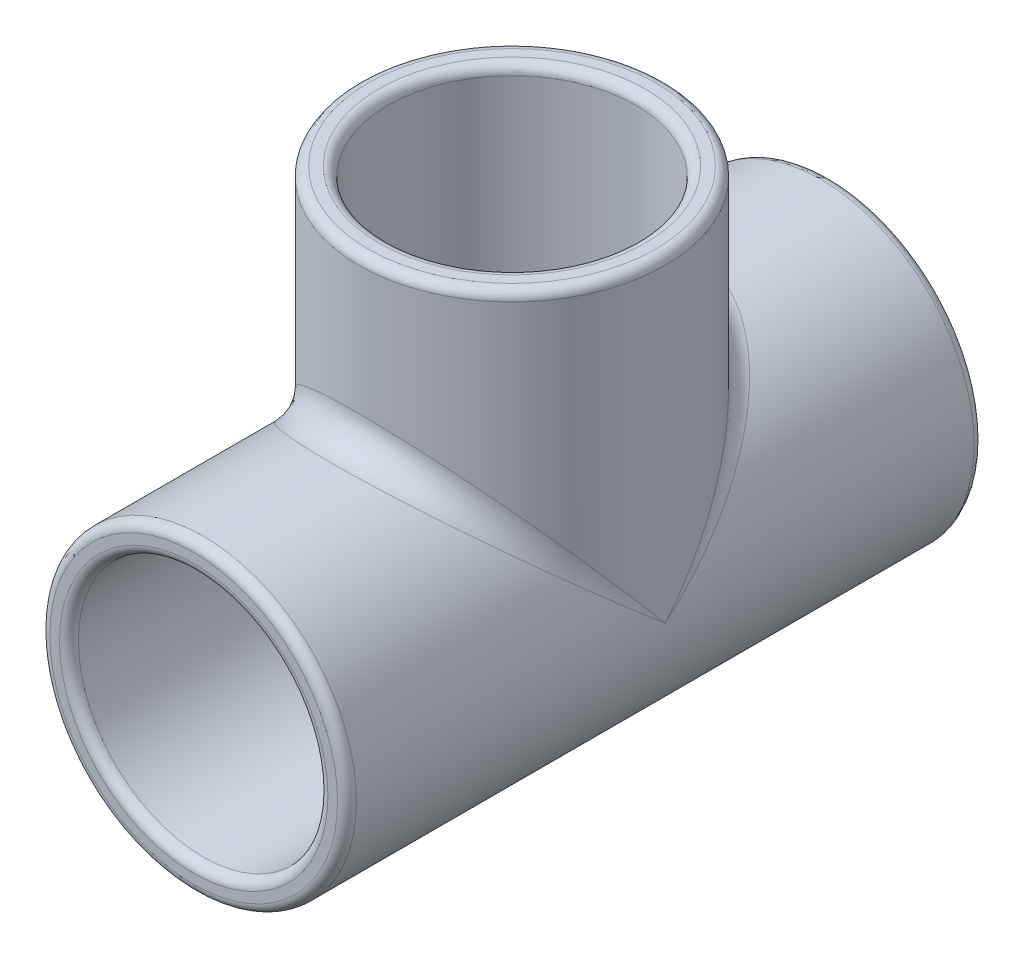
ISO-10303-21;
HEADER;
FILE_DESCRIPTION(('STEP AP214'),'2;1');
FILE_NAME('part.step','',(''),(''),'','','');
FILE_SCHEMA(('AUTOMOTIVE_DESIGN { 1 0 10303 214 1 1 1 1 }'));
ENDSEC;
DATA;
#1=APPLICATION_CONTEXT('core data for automotive mechanical design processes');
#2=APPLICATION_PROTOCOL_DEFINITION('international standard','automotive_design',2000,#1);
#3=PRODUCT_CONTEXT('',#1,'mechanical');
#4=PRODUCT('Part','Part','',(#3));
#5=PRODUCT_RELATED_PRODUCT_CATEGORY('part','',(#4));
#6=PRODUCT_DEFINITION_FORMATION('','',#4);
#7=PRODUCT_DEFINITION_CONTEXT('part definition',#1,'design');
#8=PRODUCT_DEFINITION('design','',#6,#7);
#9=PRODUCT_DEFINITION_SHAPE('','',#8);
#10=(LENGTH_UNIT() NAMED_UNIT(*) SI_UNIT(.MILLI.,.METRE.));
#11=(NAMED_UNIT(*) PLANE_ANGLE_UNIT() SI_UNIT($,.RADIAN.));
#12=(NAMED_UNIT(*) SI_UNIT($,.STERADIAN.) SOLID_ANGLE_UNIT());
#13=UNCERTAINTY_MEASURE_WITH_UNIT(LENGTH_MEASURE(1.E-05),#10,'distance_accuracy_value','');
#14=(GEOMETRIC_REPRESENTATION_CONTEXT(3) GLOBAL_UNCERTAINTY_ASSIGNED_CONTEXT((#13)) GLOBAL_UNIT_ASSIGNED_CONTEXT((#10,
#11,#12)) REPRESENTATION_CONTEXT('',''));
#15=CARTESIAN_POINT('',(0.,0.,0.));
#16=DIRECTION('',(0.,0.,1.));
#17=DIRECTION('',(1.,0.,0.));
#18=AXIS2_PLACEMENT_3D('',#15,#16,#17);
#19=CARTESIAN_POINT('',(0.,42.9895,42.8625));
#20=DIRECTION('',(0.,-1.,0.));
#21=DIRECTION('',(0.,0.,-1.));
#22=AXIS2_PLACEMENT_3D('',#19,#20,#21);
#23=CYLINDRICAL_SURFACE('',#22,13.8200475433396);
#24=CARTESIAN_POINT('',(0.,14.3478522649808,29.0424524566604));
#25=CARTESIAN_POINT('',(-0.312319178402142,14.3478488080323,29.0424559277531));
#26=CARTESIAN_POINT('',(-0.62473009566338,14.3376307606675,29.0530634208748));
#27=CARTESIAN_POINT('',(-1.24694819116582,14.2969685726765,29.0952856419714));
#28=CARTESIAN_POINT('',(-1.55675353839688,14.2665112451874,29.1269140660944));
#29=CARTESIAN_POINT('',(-2.17174254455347,14.1859363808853,29.2106221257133));
#30=CARTESIAN_POINT('',(-2.47691363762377,14.1357728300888,29.262749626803));
#31=CARTESIAN_POINT('',(-3.07951935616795,14.016838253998,29.3864141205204));
#32=CARTESIAN_POINT('',(-3.37695505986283,13.948069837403,29.4579483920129));
#33=CARTESIAN_POINT('',(-3.96009319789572,13.7937971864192,29.6185510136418));
#34=CARTESIAN_POINT('',(-4.2458652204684,13.7084182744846,29.7074880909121));
#35=CARTESIAN_POINT('',(-4.8064825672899,13.5220510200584,29.9018105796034));
#36=CARTESIAN_POINT('',(-5.08132776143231,13.4210624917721,30.0071961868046));
#37=CARTESIAN_POINT('',(-5.61891187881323,13.2050211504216,30.2329116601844));
#38=CARTESIAN_POINT('',(-5.88165562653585,13.0899740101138,30.3532354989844));
#39=CARTESIAN_POINT('',(-6.3944733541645,12.8472601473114,30.6074451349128));
#40=CARTESIAN_POINT('',(-6.64454438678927,12.7195905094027,30.7413340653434));
#41=CARTESIAN_POINT('',(-7.2311272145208,12.3985712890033,31.0785668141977));
#42=CARTESIAN_POINT('',(-7.56118582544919,12.1997072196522,31.287928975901));
#43=CARTESIAN_POINT('',(-8.19473446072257,11.7835042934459,31.7274732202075));
#44=CARTESIAN_POINT('',(-8.49821480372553,11.5661587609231,31.9576628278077));
#45=CARTESIAN_POINT('',(-9.0793964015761,11.1157953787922,32.4365509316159));
#46=CARTESIAN_POINT('',(-9.35702917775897,10.8827385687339,32.685295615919));
#47=CARTESIAN_POINT('',(-9.8860529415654,10.4045169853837,33.1983675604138));
#48=CARTESIAN_POINT('',(-10.1374454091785,10.1593528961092,33.4626939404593));
#49=CARTESIAN_POINT('',(-10.6960113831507,9.57448578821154,34.0975837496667));
#50=CARTESIAN_POINT('',(-10.9930084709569,9.23103130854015,34.4736598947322));
#51=CARTESIAN_POINT('',(-11.5428974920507,8.5334388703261,35.2479717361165));
#52=CARTESIAN_POINT('',(-11.7957600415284,8.17929397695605,35.6462219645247));
#53=CARTESIAN_POINT('',(-12.1426976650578,7.64596130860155,36.2592035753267));
#54=CARTESIAN_POINT('',(-12.2528907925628,7.46794551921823,36.4659948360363));
#55=CARTESIAN_POINT('',(-12.4627282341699,7.11223399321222,36.8851200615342));
#56=CARTESIAN_POINT('',(-12.5623735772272,6.93453822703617,37.0974534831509));
#57=CARTESIAN_POINT('',(-12.7511319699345,6.581004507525,37.5279387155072));
#58=CARTESIAN_POINT('',(-12.8402534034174,6.40516517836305,37.7460857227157));
#59=CARTESIAN_POINT('',(-13.0080562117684,6.05711184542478,38.189136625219));
#60=CARTESIAN_POINT('',(-13.0867399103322,5.8848970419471,38.4140390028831));
#61=CARTESIAN_POINT('',(-13.2094115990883,5.60246640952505,38.7966463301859));
#62=CARTESIAN_POINT('',(-13.256299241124,5.49048891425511,38.9521229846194));
#63=CARTESIAN_POINT('',(-13.3452353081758,5.27063640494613,39.2673313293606));
#64=CARTESIAN_POINT('',(-13.3872835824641,5.16276151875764,39.4270631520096));
#65=CARTESIAN_POINT('',(-13.4663687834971,4.95281128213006,39.7514713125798));
#66=CARTESIAN_POINT('',(-13.5034072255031,4.85073418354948,39.9161461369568));
#67=CARTESIAN_POINT('',(-13.5722055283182,4.65477225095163,40.2513318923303));
#68=CARTESIAN_POINT('',(-13.603966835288,4.56088517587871,40.4218412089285));
#69=CARTESIAN_POINT('',(-13.6727558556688,4.35118560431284,40.8355236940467));
#70=CARTESIAN_POINT('',(-13.7072399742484,4.24049009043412,41.0818124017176));
#71=CARTESIAN_POINT('',(-13.7635484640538,4.05404063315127,41.5885776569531));
#72=CARTESIAN_POINT('',(-13.7854122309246,3.97817810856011,41.849007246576));
#73=CARTESIAN_POINT('',(-13.811416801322,3.88684168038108,42.3291869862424));
#74=CARTESIAN_POINT('',(-13.8181726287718,3.86250877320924,42.5470298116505));
#75=CARTESIAN_POINT('',(-13.8212385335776,3.85153096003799,42.9835297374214));
#76=CARTESIAN_POINT('',(-13.8175602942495,3.86484390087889,43.2021856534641));
#77=CARTESIAN_POINT('',(-13.7981073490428,3.93376931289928,43.6857690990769));
#78=CARTESIAN_POINT('',(-13.7796423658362,3.99876334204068,43.949212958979));
#79=CARTESIAN_POINT('',(-13.74212557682,4.12513610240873,44.3337480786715));
#80=CARTESIAN_POINT('',(-13.7279292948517,4.17224833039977,44.4604975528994));
#81=CARTESIAN_POINT('',(-13.696515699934,4.27424651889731,44.7104672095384));
#82=CARTESIAN_POINT('',(-13.6792986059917,4.32913191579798,44.8336876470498));
#83=CARTESIAN_POINT('',(-13.6359078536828,4.46423748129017,45.1169522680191));
#84=CARTESIAN_POINT('',(-13.6086557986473,4.54683059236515,45.2756867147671));
#85=CARTESIAN_POINT('',(-13.5495785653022,4.71997925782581,45.5879086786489));
#86=CARTESIAN_POINT('',(-13.5177511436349,4.8105387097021,45.741393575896));
#87=CARTESIAN_POINT('',(-13.4157026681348,5.0910875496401,46.195556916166));
#88=CARTESIAN_POINT('',(-13.3389943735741,5.28969217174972,46.4894449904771));
#89=CARTESIAN_POINT('',(-13.1689495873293,5.69995614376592,47.0652270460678));
#90=CARTESIAN_POINT('',(-13.0755237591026,5.91168142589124,47.3470459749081));
#91=CARTESIAN_POINT('',(-12.8727173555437,6.34116483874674,47.8996996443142));
#92=CARTESIAN_POINT('',(-12.7633508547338,6.55891751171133,48.1705438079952));
#93=CARTESIAN_POINT('',(-12.5500540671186,6.95688892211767,48.6544219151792));
#94=CARTESIAN_POINT('',(-12.4487823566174,7.13669522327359,48.8689757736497));
#95=CARTESIAN_POINT('',(-12.2354390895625,7.49657748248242,49.2924251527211));
#96=CARTESIAN_POINT('',(-12.123366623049,7.6766534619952,49.5013201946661));
#97=CARTESIAN_POINT('',(-11.7705739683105,8.21576947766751,50.1201221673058));
#98=CARTESIAN_POINT('',(-11.5133706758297,8.57352278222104,50.5219368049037));
#99=CARTESIAN_POINT('',(-10.9547420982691,9.2766135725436,51.3014721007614));
#100=CARTESIAN_POINT('',(-10.6534962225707,9.62199466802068,51.6792819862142));
#101=CARTESIAN_POINT('',(-10.0044044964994,10.2951988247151,52.409432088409));
#102=CARTESIAN_POINT('',(-9.65659276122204,10.6230344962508,52.7617906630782));
#103=CARTESIAN_POINT('',(-9.04504011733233,11.1421291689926,53.3164796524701));
#104=CARTESIAN_POINT('',(-8.79531147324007,11.3405429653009,53.5276490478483));
#105=CARTESIAN_POINT('',(-8.27559366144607,11.7251817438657,53.9357744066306));
#106=CARTESIAN_POINT('',(-8.00560588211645,11.9114075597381,54.1327313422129));
#107=CARTESIAN_POINT('',(-7.44559791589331,12.2692408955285,54.5102781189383));
#108=CARTESIAN_POINT('',(-7.15559332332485,12.4408595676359,54.6908804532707));
#109=CARTESIAN_POINT('',(-6.55574597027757,12.7671279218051,55.0335785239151));
#110=CARTESIAN_POINT('',(-6.24590663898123,12.9217805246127,55.1956774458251));
#111=CARTESIAN_POINT('',(-5.66412970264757,13.1856585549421,55.4718532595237));
#112=CARTESIAN_POINT('',(-5.39525474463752,13.2980710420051,55.5893431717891));
#113=CARTESIAN_POINT('',(-4.84558561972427,13.5080597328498,55.8086006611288));
#114=CARTESIAN_POINT('',(-4.56479397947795,13.6056390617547,55.9103715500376));
#115=CARTESIAN_POINT('',(-3.99257810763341,13.7844109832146,56.0966801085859));
#116=CARTESIAN_POINT('',(-3.70115808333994,13.8656099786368,56.1812245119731));
#117=CARTESIAN_POINT('',(-3.10920704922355,14.0102287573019,56.3317164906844));
#118=CARTESIAN_POINT('',(-2.80867596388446,14.0736483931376,56.3976639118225));
#119=CARTESIAN_POINT('',(-2.19858037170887,14.1818085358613,56.5100924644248));
#120=CARTESIAN_POINT('',(-1.88896989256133,14.2264251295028,56.5564444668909));
#121=CARTESIAN_POINT('',(-1.265071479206,14.2954170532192,56.6281054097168));
#122=CARTESIAN_POINT('',(-0.950783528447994,14.3197923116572,56.6534142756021));
#123=CARTESIAN_POINT('',(-0.320377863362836,14.3477434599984,56.6824351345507));
#124=CARTESIAN_POINT('',(-0.00426071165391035,14.3513254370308,56.68615344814));
#125=CARTESIAN_POINT('',(0.627014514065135,14.3376207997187,56.6719251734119));
#126=CARTESIAN_POINT('',(0.942172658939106,14.3203357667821,56.6539802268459));
#127=CARTESIAN_POINT('',(1.53600068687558,14.2681791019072,56.5998152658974));
#128=CARTESIAN_POINT('',(1.81504579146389,14.2353312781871,56.5656981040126));
#129=CARTESIAN_POINT('',(2.36825024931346,14.1538126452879,56.4809945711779));
#130=CARTESIAN_POINT('',(2.64241001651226,14.1051431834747,56.430409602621));
#131=CARTESIAN_POINT('',(3.18424140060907,13.9927854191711,56.3135650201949));
#132=CARTESIAN_POINT('',(3.451912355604,13.9290955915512,56.2473038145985));
#133=CARTESIAN_POINT('',(3.97937483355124,13.787676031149,56.1000707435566));
#134=CARTESIAN_POINT('',(4.23916587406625,13.7099454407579,56.0190979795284));
#135=CARTESIAN_POINT('',(4.76302202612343,13.5371510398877,55.8389398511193));
#136=CARTESIAN_POINT('',(5.0266083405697,13.4413966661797,55.7390269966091));
#137=CARTESIAN_POINT('',(5.54294537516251,13.2368340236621,55.5253424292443));
#138=CARTESIAN_POINT('',(5.79569255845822,13.1280215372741,55.4115662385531));
#139=CARTESIAN_POINT('',(6.28961183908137,12.8986739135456,55.1714359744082));
#140=CARTESIAN_POINT('',(6.53078364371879,12.7781384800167,55.0450815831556));
#141=CARTESIAN_POINT('',(7.00113561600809,12.5266164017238,54.7809975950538));
#142=CARTESIAN_POINT('',(7.23031448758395,12.3956286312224,54.6432667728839));
#143=CARTESIAN_POINT('',(7.79923783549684,12.0497516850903,54.2789020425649));
#144=CARTESIAN_POINT('',(8.13044438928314,11.8283500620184,54.045044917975));
#145=CARTESIAN_POINT('',(8.763310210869,11.3674364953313,53.5563330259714));
#146=CARTESIAN_POINT('',(9.06496457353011,11.1279215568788,53.3014747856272));
#147=CARTESIAN_POINT('',(9.64008812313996,10.6336147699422,52.7728706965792));
#148=CARTESIAN_POINT('',(9.91346325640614,10.3787761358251,52.4990665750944));
#149=CARTESIAN_POINT('',(10.4315345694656,9.85793609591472,51.9357148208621));
#150=CARTESIAN_POINT('',(10.6762358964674,9.59193670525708,51.6461700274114));
#151=CARTESIAN_POINT('',(11.2037266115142,8.97472351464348,50.9682839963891));
#152=CARTESIAN_POINT('',(11.4774875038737,8.62083447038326,50.575309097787));
#153=CARTESIAN_POINT('',(11.8549906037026,8.08504391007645,49.9695058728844));
#154=CARTESIAN_POINT('',(11.9753668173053,7.90550706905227,49.7647148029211));
#155=CARTESIAN_POINT('',(12.2052070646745,7.54581343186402,49.34963555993));
#156=CARTESIAN_POINT('',(12.3146722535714,7.36565670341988,49.1393479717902));
#157=CARTESIAN_POINT('',(12.5227168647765,7.00610589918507,48.7132634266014));
#158=CARTESIAN_POINT('',(12.6213077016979,6.82671121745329,48.4974725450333));
#159=CARTESIAN_POINT('',(12.8078073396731,6.47003901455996,48.0596539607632));
#160=CARTESIAN_POINT('',(12.8957176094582,6.29276120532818,47.8376271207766));
#161=CARTESIAN_POINT('',(13.060739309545,5.94267106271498,47.3866992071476));
#162=CARTESIAN_POINT('',(13.1378660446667,5.76985269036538,47.1578084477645));
#163=CARTESIAN_POINT('',(13.2812865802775,5.43156834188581,46.6914288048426));
#164=CARTESIAN_POINT('',(13.3475852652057,5.26609907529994,46.4539438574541));
#165=CARTESIAN_POINT('',(13.4467739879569,5.00568662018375,46.0567460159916));
#166=CARTESIAN_POINT('',(13.4830235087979,4.90705286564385,45.9002982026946));
#167=CARTESIAN_POINT('',(13.5507827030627,4.71670836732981,45.5821472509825));
#168=CARTESIAN_POINT('',(13.5822911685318,4.62499939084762,45.4204427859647));
#169=CARTESIAN_POINT('',(13.6401020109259,4.45160615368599,45.0916405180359));
#170=CARTESIAN_POINT('',(13.6664254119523,4.36988194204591,44.9245678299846));
#171=CARTESIAN_POINT('',(13.7135069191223,4.21980745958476,44.5838383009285));
#172=CARTESIAN_POINT('',(13.7342694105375,4.15144666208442,44.4101867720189));
#173=CARTESIAN_POINT('',(13.7734286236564,4.01985695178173,44.0171975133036));
#174=CARTESIAN_POINT('',(13.7903181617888,3.96101003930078,43.7961652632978));
#175=CARTESIAN_POINT('',(13.8133643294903,3.87991914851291,43.3471332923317));
#176=CARTESIAN_POINT('',(13.8195484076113,3.85758156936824,43.1191529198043));
#177=CARTESIAN_POINT('',(13.8204896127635,3.85421178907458,42.6620179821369));
#178=CARTESIAN_POINT('',(13.8152055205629,3.87332858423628,42.4328621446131));
#179=CARTESIAN_POINT('',(13.7937801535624,3.94890687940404,41.9811199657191));
#180=CARTESIAN_POINT('',(13.7776115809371,4.00546226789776,41.7585516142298));
#181=CARTESIAN_POINT('',(13.7396037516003,4.13373354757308,41.3627575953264));
#182=CARTESIAN_POINT('',(13.7192994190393,4.20091801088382,41.1878357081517));
#183=CARTESIAN_POINT('',(13.6730388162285,4.3491267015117,40.8446499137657));
#184=CARTESIAN_POINT('',(13.647077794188,4.43016255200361,40.6763917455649));
#185=CARTESIAN_POINT('',(13.5899137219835,4.60254201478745,40.3452955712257));
#186=CARTESIAN_POINT('',(13.5586882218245,4.69392919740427,40.1824845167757));
#187=CARTESIAN_POINT('',(13.4914360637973,4.88386985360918,39.8622309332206));
#188=CARTESIAN_POINT('',(13.4554107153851,4.98242136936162,39.7047869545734));
#189=CARTESIAN_POINT('',(13.3612591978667,5.23090718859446,39.3234642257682));
#190=CARTESIAN_POINT('',(13.3005579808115,5.383736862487,39.1021151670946));
#191=CARTESIAN_POINT('',(13.1697898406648,5.69616136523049,38.667035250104));
#192=CARTESIAN_POINT('',(13.0997192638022,5.85575881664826,38.4533074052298));
#193=CARTESIAN_POINT('',(12.9502853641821,6.17922009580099,38.031989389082));
#194=CARTESIAN_POINT('',(12.8709105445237,6.34308900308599,37.8244072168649));
#195=CARTESIAN_POINT('',(12.7029610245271,6.67307600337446,37.4147952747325));
#196=CARTESIAN_POINT('',(12.6143851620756,6.83919437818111,37.2127662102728));
#197=CARTESIAN_POINT('',(12.4279258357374,7.17244786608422,36.8136220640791));
#198=CARTESIAN_POINT('',(12.3300356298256,7.33958363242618,36.6165106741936));
#199=CARTESIAN_POINT('',(12.1249082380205,7.67371643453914,36.2270850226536));
#200=CARTESIAN_POINT('',(12.0176702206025,7.84071345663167,36.0347711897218));
#201=CARTESIAN_POINT('',(11.6819318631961,8.33990196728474,35.4651695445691));
#202=CARTESIAN_POINT('',(11.4392177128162,8.67063418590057,35.0948155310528));
#203=CARTESIAN_POINT('',(10.9513425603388,9.27677857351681,34.4239643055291));
#204=CARTESIAN_POINT('',(10.7112448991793,9.55347242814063,34.1209286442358));
#205=CARTESIAN_POINT('',(10.201157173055,10.0963341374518,33.5307126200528));
#206=CARTESIAN_POINT('',(9.93116146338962,10.3624999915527,33.2435352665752));
#207=CARTESIAN_POINT('',(9.3612373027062,10.8800706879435,32.6880767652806));
#208=CARTESIAN_POINT('',(9.06138592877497,11.1315110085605,32.4197498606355));
#209=CARTESIAN_POINT('',(8.43052614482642,11.6165981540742,31.9041317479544));
#210=CARTESIAN_POINT('',(8.099516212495,11.8502441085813,31.6568415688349));
#211=CARTESIAN_POINT('',(7.50057695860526,12.2348768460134,31.2509527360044));
#212=CARTESIAN_POINT('',(7.23993596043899,12.3910772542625,31.0865085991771));
#213=CARTESIAN_POINT('',(6.70242795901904,12.6898706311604,30.7725042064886));
#214=CARTESIAN_POINT('',(6.42556523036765,12.8324671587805,30.622940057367));
#215=CARTESIAN_POINT('',(5.85620761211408,13.1020949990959,30.3405391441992));
#216=CARTESIAN_POINT('',(5.56371585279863,13.2291294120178,30.2076990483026));
#217=CARTESIAN_POINT('',(4.96408841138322,13.4656040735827,29.9606933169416));
#218=CARTESIAN_POINT('',(4.65695535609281,13.5750474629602,29.846524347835));
#219=CARTESIAN_POINT('',(4.07646899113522,13.7594209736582,29.6543535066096));
#220=CARTESIAN_POINT('',(3.80492026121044,13.8370644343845,29.5734967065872));
#221=CARTESIAN_POINT('',(3.25367514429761,13.9769552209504,29.4278978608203));
#222=CARTESIAN_POINT('',(2.97398027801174,14.0392054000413,29.363152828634));
#223=CARTESIAN_POINT('',(2.40866357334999,14.1471495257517,29.2509268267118));
#224=CARTESIAN_POINT('',(2.12305618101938,14.1928797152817,29.2034080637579));
#225=CARTESIAN_POINT('',(1.54732923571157,14.2671225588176,29.1262797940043));
#226=CARTESIAN_POINT('',(1.2572122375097,14.2956446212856,29.0966605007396));
#227=CARTESIAN_POINT('',(0.80543338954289,14.3261317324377,29.0650035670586));
#228=CARTESIAN_POINT('',(0.644592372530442,14.3342708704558,29.0565529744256));
#229=CARTESIAN_POINT('',(0.32250909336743,14.3451324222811,29.0452761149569));
#230=CARTESIAN_POINT('',(0.161266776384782,14.3478540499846,29.0424506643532));
#231=CARTESIAN_POINT('',(0.,14.3478522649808,29.0424524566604));
#232=B_SPLINE_CURVE_WITH_KNOTS('',3,(#24,#25,#26,#27,#28,#29,#30,#31,#32,#33,#34,#35,#36,#37,
#38,#39,#40,#41,#42,#43,#44,#45,#46,#47,#48,#49,#50,#51,#52,#53,#54,#55,#56,#57,#58,#59,#60,#61,
#62,#63,#64,#65,#66,#67,#68,#69,#70,#71,#72,#73,#74,#75,#76,#77,#78,#79,#80,#81,#82,#83,#84,#85,
#86,#87,#88,#89,#90,#91,#92,#93,#94,#95,#96,#97,#98,#99,#100,#101,#102,#103,#104,#105,#106,#107,
#108,#109,#110,#111,#112,#113,#114,#115,#116,#117,#118,#119,#120,#121,#122,#123,#124,#125,#126,
#127,#128,#129,#130,#131,#132,#133,#134,#135,#136,#137,#138,#139,#140,#141,#142,#143,#144,#145,
#146,#147,#148,#149,#150,#151,#152,#153,#154,#155,#156,#157,#158,#159,#160,#161,#162,#163,#164,
#165,#166,#167,#168,#169,#170,#171,#172,#173,#174,#175,#176,#177,#178,#179,#180,#181,#182,#183,
#184,#185,#186,#187,#188,#189,#190,#191,#192,#193,#194,#195,#196,#197,#198,#199,#200,#201,#202,
#203,#204,#205,#206,#207,#208,#209,#210,#211,#212,#213,#214,#215,#216,#217,#218,#219,#220,#221,
#222,#223,#224,#225,#226,#227,#228,#229,#230,#231),.UNSPECIFIED.,.T.,.F.,(4,2,2,2,2,2,2,2,2,2,2,
2,2,2,2,2,2,2,2,2,2,2,2,2,2,2,2,2,2,2,2,2,2,2,2,2,2,2,2,2,2,2,2,2,2,2,2,2,2,2,2,2,2,2,2,2,2,2,2,
2,2,2,2,2,2,2,2,2,2,2,2,2,2,2,2,2,2,2,2,2,2,2,2,2,2,2,2,2,2,2,2,2,2,2,2,2,2,2,2,2,2,2,2,4),(0.,
0.936773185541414,1.87415732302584,2.81374338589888,3.7531977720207,4.68582134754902,
5.61845602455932,6.55071561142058,7.48319102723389,8.79685399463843,10.1109935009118,
11.4285210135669,12.7459741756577,14.5122866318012,16.279770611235,17.1623863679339,
18.044915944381,18.9267376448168,19.8083626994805,20.4000139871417,20.9916836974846,
21.5831740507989,22.1745020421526,22.9892293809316,23.8013995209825,24.4560408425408,
25.1099494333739,25.9207322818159,26.3284338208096,26.7361058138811,27.2787012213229,
27.821563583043,28.9089787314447,30.0023885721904,31.0948387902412,31.987660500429,
32.8805574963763,34.6672121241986,36.4467816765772,38.2250545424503,39.3717738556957,
40.5184146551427,41.6641720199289,42.8097318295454,43.7515053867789,44.6930802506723,
45.6342863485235,46.5755002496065,47.5228233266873,48.4701497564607,49.4171988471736,
50.3641761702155,51.2123171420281,52.0603859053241,52.9085408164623,53.756747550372,
54.6490078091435,55.5415570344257,56.4341288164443,57.3267968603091,58.7105735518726,
60.0945795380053,61.4830498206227,62.8712704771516,64.6552398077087,65.5483421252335,
66.4413497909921,67.3334109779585,68.2253493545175,69.1160086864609,70.0062651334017,
70.5714574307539,71.1367934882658,71.6997878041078,72.2623368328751,72.9477543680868,
73.6314118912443,74.3175307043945,75.0053767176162,75.5699894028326,76.135078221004,
76.7026407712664,77.270048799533,78.0968235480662,78.9239216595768,79.7520527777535,
80.5802886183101,81.4091285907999,82.2380423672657,83.8941807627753,85.3193178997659,
86.7447245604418,88.1665422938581,89.5884295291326,90.6240889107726,91.659476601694,
92.6946576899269,93.7296537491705,94.6100936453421,95.4903702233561,96.3687036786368,
97.2465564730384,97.7301914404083,98.2138965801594),.UNSPECIFIED.);
#233=CARTESIAN_POINT('',(0.,14.3478522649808,29.0424524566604));
#234=VERTEX_POINT('',#233);
#235=EDGE_CURVE('E151',#234,#234,#232,.T.);
#236=ORIENTED_EDGE('',*,*,#235,.F.);
#237=EDGE_LOOP('',(#236));
#238=FACE_BOUND('',#237,.T.);
#239=CARTESIAN_POINT('',(0.,17.5895,42.8625));
#240=DIRECTION('',(0.,1.,0.));
#241=DIRECTION('',(0.,0.,1.));
#242=AXIS2_PLACEMENT_3D('',#239,#240,#241);
#243=CIRCLE('',#242,13.8200475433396);
#244=CARTESIAN_POINT('',(0.,17.5895,56.6825475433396));
#245=VERTEX_POINT('',#244);
#246=EDGE_CURVE('E91',#245,#245,#243,.T.);
#247=ORIENTED_EDGE('',*,*,#246,.T.);
#248=EDGE_LOOP('',(#247));
#249=FACE_BOUND('',#248,.T.);
#250=ADVANCED_FACE('F45',(#238,#249),#23,.F.);
#251=CARTESIAN_POINT('',(0.,0.,73.9394));
#252=DIRECTION('',(0.,0.,-1.));
#253=DIRECTION('',(-1.,0.,0.));
#254=AXIS2_PLACEMENT_3D('',#251,#252,#253);
#255=CYLINDRICAL_SURFACE('',#254,14.3478522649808);
#256=CARTESIAN_POINT('',(0.,0.,25.4));
#257=DIRECTION('',(0.,0.,-1.));
#258=DIRECTION('',(-1.,0.,0.));
#259=AXIS2_PLACEMENT_3D('',#256,#257,#258);
#260=CIRCLE('',#259,14.3478522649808);
#261=CARTESIAN_POINT('',(-14.3478522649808,0.,25.4));
#262=VERTEX_POINT('',#261);
#263=EDGE_CURVE('E84',#262,#262,#260,.T.);
#264=ORIENTED_EDGE('',*,*,#263,.T.);
#265=EDGE_LOOP('',(#264));
#266=FACE_BOUND('',#265,.T.);
#267=CARTESIAN_POINT('',(0.,0.,60.325));
#268=DIRECTION('',(0.,0.,1.));
#269=DIRECTION('',(1.,0.,0.));
#270=AXIS2_PLACEMENT_3D('',#267,#268,#269);
#271=CIRCLE('',#270,14.3478522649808);
#272=CARTESIAN_POINT('',(14.3478522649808,0.,60.325));
#273=VERTEX_POINT('',#272);
#274=EDGE_CURVE('E159',#273,#273,#271,.T.);
#275=ORIENTED_EDGE('',*,*,#274,.T.);
#276=EDGE_LOOP('',(#275));
#277=FACE_BOUND('',#276,.T.);
#278=ORIENTED_EDGE('',*,*,#235,.T.);
#279=EDGE_LOOP('',(#278));
#280=FACE_BOUND('',#279,.T.);
#281=ADVANCED_FACE('F135',(#266,#277,#280),#255,.F.);
#282=CARTESIAN_POINT('',(0.,0.,85.725));
#283=DIRECTION('',(0.,0.,-1.));
#284=DIRECTION('',(-1.,0.,0.));
#285=AXIS2_PLACEMENT_3D('',#282,#283,#284);
#286=CYLINDRICAL_SURFACE('',#285,20.6375);
#287=CARTESIAN_POINT('',(0.,0.,1.26999999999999));
#288=DIRECTION('',(0.,0.,1.));
#289=DIRECTION('',(1.,0.,0.));
#290=AXIS2_PLACEMENT_3D('',#287,#288,#289);
#291=CIRCLE('',#290,20.6375);
#292=CARTESIAN_POINT('',(20.6375,0.,1.26999999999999));
#293=VERTEX_POINT('',#292);
#294=EDGE_CURVE('E219',#293,#293,#291,.T.);
#295=ORIENTED_EDGE('',*,*,#294,.T.);
#296=EDGE_LOOP('',(#295));
#297=FACE_BOUND('',#296,.T.);
#298=CARTESIAN_POINT('',(0.,0.,84.455));
#299=DIRECTION('',(0.,0.,1.));
#300=DIRECTION('',(1.,0.,0.));
#301=AXIS2_PLACEMENT_3D('',#298,#299,#300);
#302=CIRCLE('',#301,20.6375);
#303=CARTESIAN_POINT('',(20.6375,0.,84.455));
#304=VERTEX_POINT('',#303);
#305=EDGE_CURVE('E215',#304,#304,#302,.F.);
#306=ORIENTED_EDGE('',*,*,#305,.T.);
#307=EDGE_LOOP('',(#306));
#308=FACE_BOUND('',#307,.T.);
#309=CARTESIAN_POINT('',(0.,0.,42.8625));
#310=DIRECTION('',(0.,0.764138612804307,0.645052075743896));
#311=DIRECTION('',(0.,-0.645052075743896,0.764138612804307));
#312=AXIS2_PLACEMENT_3D('',#309,#310,#311);
#313=ELLIPSE('',#312,31.993540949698,20.6375);
#314=CARTESIAN_POINT('',(-20.6375,0.,42.8625));
#315=VERTEX_POINT('',#314);
#316=CARTESIAN_POINT('',(20.6375,0.,42.8625));
#317=VERTEX_POINT('',#316);
#318=EDGE_CURVE('E60',#315,#317,#313,.F.);
#319=ORIENTED_EDGE('',*,*,#318,.T.);
#320=CARTESIAN_POINT('',(0.,0.,42.8625));
#321=DIRECTION('',(0.,0.764138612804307,-0.645052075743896));
#322=DIRECTION('',(0.,-0.645052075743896,-0.764138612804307));
#323=AXIS2_PLACEMENT_3D('',#320,#321,#322);
#324=ELLIPSE('',#323,31.993540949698,20.6375);
#325=EDGE_CURVE('E65',#317,#315,#324,.F.);
#326=ORIENTED_EDGE('',*,*,#325,.T.);
#327=EDGE_LOOP('',(#319,#326));
#328=FACE_BOUND('',#327,.T.);
#329=ADVANCED_FACE('F74',(#297,#308,#328),#286,.T.);
#330=CARTESIAN_POINT('',(0.,0.,85.725));
#331=DIRECTION('',(0.,0.,1.));
#332=DIRECTION('',(1.,0.,0.));
#333=AXIS2_PLACEMENT_3D('',#330,#331,#332);
#334=PLANE('',#333);
#335=CARTESIAN_POINT('',(0.,0.,85.725));
#336=DIRECTION('',(0.,0.,1.));
#337=DIRECTION('',(1.,0.,0.));
#338=AXIS2_PLACEMENT_3D('',#335,#336,#337);
#339=CIRCLE('',#338,18.0721);
#340=CARTESIAN_POINT('',(18.0721,0.,85.725));
#341=VERTEX_POINT('',#340);
#342=EDGE_CURVE('E54',#341,#341,#339,.F.);
#343=ORIENTED_EDGE('',*,*,#342,.T.);
#344=EDGE_LOOP('',(#343));
#345=FACE_BOUND('',#344,.T.);
#346=CARTESIAN_POINT('',(0.,0.,85.725));
#347=DIRECTION('',(0.,0.,1.));
#348=DIRECTION('',(1.,0.,0.));
#349=AXIS2_PLACEMENT_3D('',#346,#347,#348);
#350=CIRCLE('',#349,19.3675);
#351=CARTESIAN_POINT('',(19.3675,0.,85.725));
#352=VERTEX_POINT('',#351);
#353=EDGE_CURVE('E227',#352,#352,#350,.T.);
#354=ORIENTED_EDGE('',*,*,#353,.T.);
#355=EDGE_LOOP('',(#354));
#356=FACE_BOUND('',#355,.T.);
#357=ADVANCED_FACE('F125',(#345,#356),#334,.T.);
#358=CARTESIAN_POINT('',(0.,0.,0.));
#359=DIRECTION('',(0.,0.,1.));
#360=DIRECTION('',(1.,0.,0.));
#361=AXIS2_PLACEMENT_3D('',#358,#359,#360);
#362=PLANE('',#361);
#363=CARTESIAN_POINT('',(0.,0.,0.));
#364=DIRECTION('',(0.,0.,1.));
#365=DIRECTION('',(1.,0.,0.));
#366=AXIS2_PLACEMENT_3D('',#363,#364,#365);
#367=CIRCLE('',#366,18.0721);
#368=CARTESIAN_POINT('',(18.0721,0.,0.));
#369=VERTEX_POINT('',#368);
#370=EDGE_CURVE('E212',#369,#369,#367,.T.);
#371=ORIENTED_EDGE('',*,*,#370,.T.);
#372=EDGE_LOOP('',(#371));
#373=FACE_BOUND('',#372,.T.);
#374=CARTESIAN_POINT('',(0.,0.,0.));
#375=DIRECTION('',(0.,0.,1.));
#376=DIRECTION('',(1.,0.,0.));
#377=AXIS2_PLACEMENT_3D('',#374,#375,#376);
#378=CIRCLE('',#377,19.3675);
#379=CARTESIAN_POINT('',(19.3675,0.,0.));
#380=VERTEX_POINT('',#379);
#381=EDGE_CURVE('E208',#380,#380,#378,.F.);
#382=ORIENTED_EDGE('',*,*,#381,.T.);
#383=EDGE_LOOP('',(#382));
#384=FACE_BOUND('',#383,.T.);
#385=ADVANCED_FACE('F116',(#373,#384),#362,.F.);
#386=CARTESIAN_POINT('',(0.,42.9895,42.8625));
#387=DIRECTION('',(0.,-1.,0.));
#388=DIRECTION('',(0.,0.,-1.));
#389=AXIS2_PLACEMENT_3D('',#386,#387,#388);
#390=CYLINDRICAL_SURFACE('',#389,20.6375);
#391=CARTESIAN_POINT('',(0.,41.7195,42.8625));
#392=DIRECTION('',(0.,1.,0.));
#393=DIRECTION('',(0.,0.,1.));
#394=AXIS2_PLACEMENT_3D('',#391,#392,#393);
#395=CIRCLE('',#394,20.6375);
#396=CARTESIAN_POINT('',(0.,41.7195,63.5));
#397=VERTEX_POINT('',#396);
#398=EDGE_CURVE('E11',#397,#397,#395,.F.);
#399=ORIENTED_EDGE('',*,*,#398,.T.);
#400=EDGE_LOOP('',(#399));
#401=FACE_BOUND('',#400,.T.);
#402=CARTESIAN_POINT('',(0.,0.,42.8625));
#403=DIRECTION('',(0.,0.645052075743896,0.764138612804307));
#404=DIRECTION('',(0.,-0.764138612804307,0.645052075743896));
#405=AXIS2_PLACEMENT_3D('',#402,#403,#404);
#406=ELLIPSE('',#405,31.993540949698,20.6375);
#407=EDGE_CURVE('E79',#317,#315,#406,.T.);
#408=ORIENTED_EDGE('',*,*,#407,.T.);
#409=CARTESIAN_POINT('',(0.,0.,42.8625));
#410=DIRECTION('',(0.,0.645052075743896,-0.764138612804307));
#411=DIRECTION('',(0.,-0.764138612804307,-0.645052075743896));
#412=AXIS2_PLACEMENT_3D('',#409,#410,#411);
#413=ELLIPSE('',#412,31.993540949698,20.6375);
#414=EDGE_CURVE('E68',#315,#317,#413,.T.);
#415=ORIENTED_EDGE('',*,*,#414,.T.);
#416=EDGE_LOOP('',(#408,#415));
#417=FACE_BOUND('',#416,.T.);
#418=ADVANCED_FACE('F78',(#401,#417),#390,.T.);
#419=CARTESIAN_POINT('',(0.,42.9895,42.8625));
#420=DIRECTION('',(0.,1.,0.));
#421=DIRECTION('',(0.,0.,1.));
#422=AXIS2_PLACEMENT_3D('',#419,#420,#421);
#423=PLANE('',#422);
#424=CARTESIAN_POINT('',(0.,42.9895,42.8625));
#425=DIRECTION('',(0.,1.,0.));
#426=DIRECTION('',(0.,0.,1.));
#427=AXIS2_PLACEMENT_3D('',#424,#425,#426);
#428=CIRCLE('',#427,17.9705);
#429=CARTESIAN_POINT('',(0.,42.9895,60.833));
#430=VERTEX_POINT('',#429);
#431=EDGE_CURVE('E198',#430,#430,#428,.F.);
#432=ORIENTED_EDGE('',*,*,#431,.T.);
#433=EDGE_LOOP('',(#432));
#434=FACE_BOUND('',#433,.T.);
#435=CARTESIAN_POINT('',(0.,42.9895,42.8625));
#436=DIRECTION('',(0.,1.,0.));
#437=DIRECTION('',(0.,0.,1.));
#438=AXIS2_PLACEMENT_3D('',#435,#436,#437);
#439=CIRCLE('',#438,19.3675);
#440=CARTESIAN_POINT('',(0.,42.9895,62.23));
#441=VERTEX_POINT('',#440);
#442=EDGE_CURVE('E195',#441,#441,#439,.T.);
#443=ORIENTED_EDGE('',*,*,#442,.T.);
#444=EDGE_LOOP('',(#443));
#445=FACE_BOUND('',#444,.T.);
#446=ADVANCED_FACE('F115',(#434,#445),#423,.T.);
#447=CARTESIAN_POINT('',(0.,0.,85.725));
#448=DIRECTION('',(0.,0.,-1.));
#449=DIRECTION('',(-1.,0.,0.));
#450=AXIS2_PLACEMENT_3D('',#447,#448,#449);
#451=CYLINDRICAL_SURFACE('',#450,16.8021);
#452=CARTESIAN_POINT('',(0.,0.,84.455));
#453=DIRECTION('',(0.,0.,1.));
#454=DIRECTION('',(1.,0.,0.));
#455=AXIS2_PLACEMENT_3D('',#452,#453,#454);
#456=CIRCLE('',#455,16.8021);
#457=CARTESIAN_POINT('',(16.8021,0.,84.455));
#458=VERTEX_POINT('',#457);
#459=EDGE_CURVE('E223',#458,#458,#456,.T.);
#460=ORIENTED_EDGE('',*,*,#459,.T.);
#461=EDGE_LOOP('',(#460));
#462=FACE_BOUND('',#461,.T.);
#463=CARTESIAN_POINT('',(0.,0.,60.325));
#464=DIRECTION('',(0.,0.,1.));
#465=DIRECTION('',(1.,0.,0.));
#466=AXIS2_PLACEMENT_3D('',#463,#464,#465);
#467=CIRCLE('',#466,16.8021);
#468=CARTESIAN_POINT('',(16.8021,0.,60.325));
#469=VERTEX_POINT('',#468);
#470=EDGE_CURVE('E158',#469,#469,#467,.T.);
#471=ORIENTED_EDGE('',*,*,#470,.F.);
#472=EDGE_LOOP('',(#471));
#473=FACE_BOUND('',#472,.T.);
#474=ADVANCED_FACE('F119',(#462,#473),#451,.F.);
#475=CARTESIAN_POINT('',(0.,0.,25.4));
#476=DIRECTION('',(0.,0.,-1.));
#477=DIRECTION('',(-1.,0.,0.));
#478=AXIS2_PLACEMENT_3D('',#475,#476,#477);
#479=CYLINDRICAL_SURFACE('',#478,16.8021);
#480=CARTESIAN_POINT('',(0.,0.,1.27));
#481=DIRECTION('',(0.,0.,1.));
#482=DIRECTION('',(1.,0.,0.));
#483=AXIS2_PLACEMENT_3D('',#480,#481,#482);
#484=CIRCLE('',#483,16.8021);
#485=CARTESIAN_POINT('',(16.8021,0.,1.27));
#486=VERTEX_POINT('',#485);
#487=EDGE_CURVE('E204',#486,#486,#484,.F.);
#488=ORIENTED_EDGE('',*,*,#487,.T.);
#489=EDGE_LOOP('',(#488));
#490=FACE_BOUND('',#489,.T.);
#491=CARTESIAN_POINT('',(0.,0.,25.4));
#492=DIRECTION('',(0.,0.,-1.));
#493=DIRECTION('',(-1.,0.,0.));
#494=AXIS2_PLACEMENT_3D('',#491,#492,#493);
#495=CIRCLE('',#494,16.8021);
#496=CARTESIAN_POINT('',(-16.8021,0.,25.4));
#497=VERTEX_POINT('',#496);
#498=EDGE_CURVE('E88',#497,#497,#495,.T.);
#499=ORIENTED_EDGE('',*,*,#498,.F.);
#500=EDGE_LOOP('',(#499));
#501=FACE_BOUND('',#500,.T.);
#502=ADVANCED_FACE('F123',(#490,#501),#479,.F.);
#503=CARTESIAN_POINT('',(0.,0.,25.4));
#504=DIRECTION('',(0.,0.,-1.));
#505=DIRECTION('',(-1.,0.,0.));
#506=AXIS2_PLACEMENT_3D('',#503,#504,#505);
#507=PLANE('',#506);
#508=ORIENTED_EDGE('',*,*,#263,.F.);
#509=EDGE_LOOP('',(#508));
#510=FACE_BOUND('',#509,.T.);
#511=ORIENTED_EDGE('',*,*,#498,.T.);
#512=EDGE_LOOP('',(#511));
#513=FACE_BOUND('',#512,.T.);
#514=ADVANCED_FACE('F188',(#510,#513),#507,.T.);
#515=CARTESIAN_POINT('',(0.,0.,60.325));
#516=DIRECTION('',(0.,0.,1.));
#517=DIRECTION('',(1.,0.,0.));
#518=AXIS2_PLACEMENT_3D('',#515,#516,#517);
#519=PLANE('',#518);
#520=ORIENTED_EDGE('',*,*,#274,.F.);
#521=EDGE_LOOP('',(#520));
#522=FACE_BOUND('',#521,.T.);
#523=ORIENTED_EDGE('',*,*,#470,.T.);
#524=EDGE_LOOP('',(#523));
#525=FACE_BOUND('',#524,.T.);
#526=ADVANCED_FACE('F149',(#522,#525),#519,.T.);
#527=CARTESIAN_POINT('',(0.,17.5895,42.8625));
#528=DIRECTION('',(0.,1.,0.));
#529=DIRECTION('',(0.,0.,1.));
#530=AXIS2_PLACEMENT_3D('',#527,#528,#529);
#531=CYLINDRICAL_SURFACE('',#530,16.7005);
#532=CARTESIAN_POINT('',(0.,41.7195,42.8625));
#533=DIRECTION('',(0.,1.,0.));
#534=DIRECTION('',(0.,0.,1.));
#535=AXIS2_PLACEMENT_3D('',#532,#533,#534);
#536=CIRCLE('',#535,16.7005);
#537=CARTESIAN_POINT('',(0.,41.7195,59.563));
#538=VERTEX_POINT('',#537);
#539=EDGE_CURVE('E72',#538,#538,#536,.T.);
#540=ORIENTED_EDGE('',*,*,#539,.T.);
#541=EDGE_LOOP('',(#540));
#542=FACE_BOUND('',#541,.T.);
#543=CARTESIAN_POINT('',(0.,17.5895,42.8625));
#544=DIRECTION('',(0.,1.,0.));
#545=DIRECTION('',(0.,0.,1.));
#546=AXIS2_PLACEMENT_3D('',#543,#544,#545);
#547=CIRCLE('',#546,16.7005);
#548=CARTESIAN_POINT('',(0.,17.5895,59.563));
#549=VERTEX_POINT('',#548);
#550=EDGE_CURVE('E169',#549,#549,#547,.T.);
#551=ORIENTED_EDGE('',*,*,#550,.F.);
#552=EDGE_LOOP('',(#551));
#553=FACE_BOUND('',#552,.T.);
#554=ADVANCED_FACE('F179',(#542,#553),#531,.F.);
#555=CARTESIAN_POINT('',(0.,17.5895,42.8625));
#556=DIRECTION('',(0.,1.,0.));
#557=DIRECTION('',(0.,0.,1.));
#558=AXIS2_PLACEMENT_3D('',#555,#556,#557);
#559=PLANE('',#558);
#560=ORIENTED_EDGE('',*,*,#246,.F.);
#561=EDGE_LOOP('',(#560));
#562=FACE_BOUND('',#561,.T.);
#563=ORIENTED_EDGE('',*,*,#550,.T.);
#564=EDGE_LOOP('',(#563));
#565=FACE_BOUND('',#564,.T.);
#566=ADVANCED_FACE('F105',(#562,#565),#559,.T.);
#567=CARTESIAN_POINT('',(20.6375,0.,42.8625));
#568=CARTESIAN_POINT('',(20.6375,0.,42.8625));
#569=CARTESIAN_POINT('',(20.6375,0.,42.8625));
#570=CARTESIAN_POINT('',(20.6374767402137,0.449579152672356,43.3950783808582));
#571=CARTESIAN_POINT('',(20.6375637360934,0.491083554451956,43.353583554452));
#572=CARTESIAN_POINT('',(20.6374767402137,0.532578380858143,43.3120791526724));
#573=CARTESIAN_POINT('',(20.6228079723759,0.899160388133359,43.9276592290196));
#574=CARTESIAN_POINT('',(20.6200919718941,0.98251027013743,43.8450102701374));
#575=CARTESIAN_POINT('',(20.6228079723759,1.06515922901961,43.7616603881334));
#576=CARTESIAN_POINT('',(20.5640129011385,1.79739507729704,44.991721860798));
#577=CARTESIAN_POINT('',(20.5504174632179,1.96312430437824,44.8256243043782));
#578=CARTESIAN_POINT('',(20.5640129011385,2.12922186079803,44.659895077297));
#579=CARTESIAN_POINT('',(20.5198841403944,2.2460484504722,45.5232035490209));
#580=CARTESIAN_POINT('',(20.4981125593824,2.45300739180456,45.3155073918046));
#581=CARTESIAN_POINT('',(20.5198841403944,2.66070354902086,45.1085484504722));
#582=CARTESIAN_POINT('',(20.4025047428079,3.13760543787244,46.5793556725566));
#583=CARTESIAN_POINT('',(20.3592618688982,3.42471721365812,46.2872172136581));
#584=CARTESIAN_POINT('',(20.4025047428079,3.71685567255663,46.0001054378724));
#585=CARTESIAN_POINT('',(20.3295054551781,3.58052547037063,47.1040455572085));
#586=CARTESIAN_POINT('',(20.2728148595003,3.9072603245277,46.7697603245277));
#587=CARTESIAN_POINT('',(20.3295054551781,4.2415455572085,46.4430254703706));
#588=CARTESIAN_POINT('',(20.1540836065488,4.46339407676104,48.1499052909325));
#589=CARTESIAN_POINT('',(20.0656552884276,4.86684003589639,47.7293400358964));
#590=CARTESIAN_POINT('',(20.1540836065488,5.28740529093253,47.325894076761));
#591=CARTESIAN_POINT('',(20.0516617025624,4.90334271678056,48.6710752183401));
#592=CARTESIAN_POINT('',(19.9446517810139,5.34452697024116,48.2070269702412));
#593=CARTESIAN_POINT('',(20.0516617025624,5.80857521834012,47.7658427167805));
#594=CARTESIAN_POINT('',(19.7035581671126,6.20252430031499,50.2101057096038));
#595=CARTESIAN_POINT('',(19.5333768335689,6.75474221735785,49.6172422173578));
#596=CARTESIAN_POINT('',(19.7035581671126,7.34760570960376,49.065024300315));
#597=CARTESIAN_POINT('',(19.4150593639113,7.05627583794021,51.2214729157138));
#598=CARTESIAN_POINT('',(19.1923902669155,7.67692242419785,50.5394224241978));
#599=CARTESIAN_POINT('',(19.4150593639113,8.35897291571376,49.9187758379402));
#600=CARTESIAN_POINT('',(18.7266533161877,8.71825659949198,53.1902808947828));
#601=CARTESIAN_POINT('',(18.3878658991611,9.45377424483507,52.3162742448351));
#602=CARTESIAN_POINT('',(18.7266533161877,10.3277808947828,51.580756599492));
#603=CARTESIAN_POINT('',(18.3296656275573,9.52708913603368,54.1484363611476));
#604=CARTESIAN_POINT('',(17.9231840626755,10.3137658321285,53.1762658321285));
#605=CARTESIAN_POINT('',(18.3296656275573,11.2859363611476,52.3895891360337));
#606=CARTESIAN_POINT('',(17.4300813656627,11.0852122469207,55.9942129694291));
#607=CARTESIAN_POINT('',(16.884879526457,11.9477853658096,54.8102853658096));
#608=CARTESIAN_POINT('',(17.4300813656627,13.1317129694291,53.9477122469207));
#609=CARTESIAN_POINT('',(16.9312485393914,11.8355785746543,56.8831084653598));
#610=CARTESIAN_POINT('',(16.3098339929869,12.7268007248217,55.5893007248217));
#611=CARTESIAN_POINT('',(16.9312485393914,14.0206084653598,54.6980785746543));
#612=CARTESIAN_POINT('',(15.8356268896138,13.2634001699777,58.5745278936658));
#613=CARTESIAN_POINT('',(15.068876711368,14.182311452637,57.044811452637));
#614=CARTESIAN_POINT('',(15.8356268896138,15.7120278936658,56.1259001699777));
#615=CARTESIAN_POINT('',(15.2432798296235,13.9425424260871,59.3790502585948));
#616=CARTESIAN_POINT('',(14.4014474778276,14.8632503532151,57.7257503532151));
#617=CARTESIAN_POINT('',(15.2432798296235,16.5165502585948,56.8050424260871));
#618=CARTESIAN_POINT('',(13.9702594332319,15.2155826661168,60.8871133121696));
#619=CARTESIAN_POINT('',(12.9984796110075,16.1096198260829,58.9721198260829));
#620=CARTESIAN_POINT('',(13.9702594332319,18.0246133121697,58.0780826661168));
#621=CARTESIAN_POINT('',(13.2944240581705,15.8118796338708,61.593495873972));
#622=CARTESIAN_POINT('',(12.2616762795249,16.6786854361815,59.5411854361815));
#623=CARTESIAN_POINT('',(13.2944240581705,18.7309958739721,58.6743796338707));
#624=CARTESIAN_POINT('',(11.8650658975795,16.9085658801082,62.8926472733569));
#625=CARTESIAN_POINT('',(10.746259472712,17.6938283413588,60.5563283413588));
#626=CARTESIAN_POINT('',(11.8650658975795,20.030147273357,59.7710658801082));
#627=CARTESIAN_POINT('',(11.116400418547,17.4120613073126,63.4890957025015));
#628=CARTESIAN_POINT('',(9.96715692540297,18.1424999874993,61.0049999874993));
#629=CARTESIAN_POINT('',(11.116400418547,20.6265957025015,60.2745613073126));
#630=CARTESIAN_POINT('',(9.93716809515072,18.0929125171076,64.2956425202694));
#631=CARTESIAN_POINT('',(8.78843834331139,18.7233804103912,61.5858804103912));
#632=CARTESIAN_POINT('',(9.93716809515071,21.4331425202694,60.9554125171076));
#633=CARTESIAN_POINT('',(9.54437600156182,18.3033949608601,64.5449832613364));
#634=CARTESIAN_POINT('',(8.39830758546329,18.9001346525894,61.7626346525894));
#635=CARTESIAN_POINT('',(9.54437600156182,21.6824832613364,61.1658949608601));
#636=CARTESIAN_POINT('',(8.73701884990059,18.7022293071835,65.0174485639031));
#637=CARTESIAN_POINT('',(7.60936982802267,19.2282978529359,62.0907978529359));
#638=CARTESIAN_POINT('',(8.73701884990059,22.1549485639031,61.5647293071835));
#639=CARTESIAN_POINT('',(8.32246355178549,18.8905910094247,65.240584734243));
#640=CARTESIAN_POINT('',(7.21076074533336,19.3792122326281,62.2417122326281));
#641=CARTESIAN_POINT('',(8.32246355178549,22.378084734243,61.7530910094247));
#642=CARTESIAN_POINT('',(7.48936679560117,19.2356724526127,65.6493735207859));
#643=CARTESIAN_POINT('',(6.42379374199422,19.6496392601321,62.5121392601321));
#644=CARTESIAN_POINT('',(7.48936679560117,22.786873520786,62.0981724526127));
#645=CARTESIAN_POINT('',(7.07161160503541,19.3933398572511,65.836148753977));
#646=CARTESIAN_POINT('',(6.0358357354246,19.7697289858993,62.6322289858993));
#647=CARTESIAN_POINT('',(7.07161160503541,22.973648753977,62.2558398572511));
#648=CARTESIAN_POINT('',(6.21883776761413,19.6833741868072,66.1797278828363));
#649=CARTESIAN_POINT('',(5.25729697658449,19.9860034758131,62.8485034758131));
#650=CARTESIAN_POINT('',(6.21883776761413,23.3172278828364,62.5458741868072));
#651=CARTESIAN_POINT('',(5.78382006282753,19.8157424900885,66.3365334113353));
#652=CARTESIAN_POINT('',(4.86731999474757,20.081721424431,62.944221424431));
#653=CARTESIAN_POINT('',(5.78382006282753,23.4740334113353,62.6782424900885));
#654=CARTESIAN_POINT('',(4.91215074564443,20.0493051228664,66.6132152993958));
#655=CARTESIAN_POINT('',(4.09858845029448,20.2473005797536,63.1098005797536));
#656=CARTESIAN_POINT('',(4.91215074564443,23.7507152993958,62.9118051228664));
#657=CARTESIAN_POINT('',(4.47593600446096,20.151312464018,66.7340547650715));
#658=CARTESIAN_POINT('',(3.720484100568,20.3174828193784,63.1799828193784));
#659=CARTESIAN_POINT('',(4.47593600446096,23.8715547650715,63.013812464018));
#660=CARTESIAN_POINT('',(3.59235263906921,20.3274269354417,66.9426826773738));
#661=CARTESIAN_POINT('',(2.9648722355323,20.4367787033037,63.2992787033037));
#662=CARTESIAN_POINT('',(3.59235263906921,24.0801826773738,63.1899269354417));
#663=CARTESIAN_POINT('',(3.14498451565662,20.4015353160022,67.0304726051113));
#664=CARTESIAN_POINT('',(2.5882651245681,20.4855808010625,63.3480808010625));
#665=CARTESIAN_POINT('',(3.14498451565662,24.1679726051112,63.2640353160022));
#666=CARTESIAN_POINT('',(2.24984349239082,20.5193824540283,67.170076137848));
#667=CARTESIAN_POINT('',(1.84197530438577,20.5624436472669,63.4249436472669));
#668=CARTESIAN_POINT('',(2.24984349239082,24.307576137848,63.3818824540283));
#669=CARTESIAN_POINT('',(1.80219618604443,20.5635967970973,67.2224531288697));
#670=CARTESIAN_POINT('',(1.47322492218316,20.590623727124,63.4531237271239));
#671=CARTESIAN_POINT('',(1.80219618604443,24.3599531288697,63.4260967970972));
#672=CARTESIAN_POINT('',(0.903032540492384,20.6226553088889,67.292414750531));
#673=CARTESIAN_POINT('',(0.735801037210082,20.6282049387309,63.4907049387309));
#674=CARTESIAN_POINT('',(0.903032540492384,24.429914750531,63.4851553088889));
#675=CARTESIAN_POINT('',(0.451516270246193,20.6375,67.31));
#676=CARTESIAN_POINT('',(0.368165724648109,20.6375,63.5));
#677=CARTESIAN_POINT('',(0.451516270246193,24.4475,63.5));
#678=CARTESIAN_POINT('',(-0.451516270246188,20.6375,67.31));
#679=CARTESIAN_POINT('',(-0.368165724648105,20.6375,63.5));
#680=CARTESIAN_POINT('',(-0.451516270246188,24.4475,63.5));
#681=CARTESIAN_POINT('',(-0.903032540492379,20.6226553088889,67.292414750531));
#682=CARTESIAN_POINT('',(-0.735801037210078,20.6282049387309,63.4907049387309));
#683=CARTESIAN_POINT('',(-0.903032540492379,24.429914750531,63.4851553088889));
#684=CARTESIAN_POINT('',(-1.80219618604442,20.5635967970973,67.2224531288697));
#685=CARTESIAN_POINT('',(-1.47322492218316,20.590623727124,63.4531237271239));
#686=CARTESIAN_POINT('',(-1.80219618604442,24.3599531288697,63.4260967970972));
#687=CARTESIAN_POINT('',(-2.24984349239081,20.5193824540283,67.170076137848));
#688=CARTESIAN_POINT('',(-1.84197530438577,20.5624436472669,63.4249436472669));
#689=CARTESIAN_POINT('',(-2.24984349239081,24.307576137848,63.3818824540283));
#690=CARTESIAN_POINT('',(-3.14498451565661,20.4015353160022,67.0304726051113));
#691=CARTESIAN_POINT('',(-2.5882651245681,20.4855808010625,63.3480808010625));
#692=CARTESIAN_POINT('',(-3.14498451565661,24.1679726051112,63.2640353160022));
#693=CARTESIAN_POINT('',(-3.5923526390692,20.3274269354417,66.9426826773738));
#694=CARTESIAN_POINT('',(-2.96487223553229,20.4367787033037,63.2992787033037));
#695=CARTESIAN_POINT('',(-3.5923526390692,24.0801826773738,63.1899269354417));
#696=CARTESIAN_POINT('',(-4.47593600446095,20.151312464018,66.7340547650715));
#697=CARTESIAN_POINT('',(-3.72048410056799,20.3174828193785,63.1799828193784));
#698=CARTESIAN_POINT('',(-4.47593600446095,23.8715547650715,63.013812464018));
#699=CARTESIAN_POINT('',(-4.91215074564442,20.0493051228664,66.6132152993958));
#700=CARTESIAN_POINT('',(-4.09858845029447,20.2473005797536,63.1098005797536));
#701=CARTESIAN_POINT('',(-4.91215074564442,23.7507152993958,62.9118051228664));
#702=CARTESIAN_POINT('',(-5.78382006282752,19.8157424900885,66.3365334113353));
#703=CARTESIAN_POINT('',(-4.86731999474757,20.081721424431,62.944221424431));
#704=CARTESIAN_POINT('',(-5.78382006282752,23.4740334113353,62.6782424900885));
#705=CARTESIAN_POINT('',(-6.21883776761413,19.6833741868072,66.1797278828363));
#706=CARTESIAN_POINT('',(-5.25729697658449,19.9860034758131,62.8485034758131));
#707=CARTESIAN_POINT('',(-6.21883776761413,23.3172278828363,62.5458741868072));
#708=CARTESIAN_POINT('',(-7.07161160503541,19.3933398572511,65.836148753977));
#709=CARTESIAN_POINT('',(-6.0358357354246,19.7697289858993,62.6322289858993));
#710=CARTESIAN_POINT('',(-7.07161160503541,22.973648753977,62.2558398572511));
#711=CARTESIAN_POINT('',(-7.48936679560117,19.2356724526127,65.6493735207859));
#712=CARTESIAN_POINT('',(-6.42379374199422,19.6496392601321,62.5121392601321));
#713=CARTESIAN_POINT('',(-7.48936679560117,22.786873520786,62.0981724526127));
#714=CARTESIAN_POINT('',(-8.32246355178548,18.8905910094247,65.240584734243));
#715=CARTESIAN_POINT('',(-7.21076074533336,19.3792122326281,62.2417122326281));
#716=CARTESIAN_POINT('',(-8.32246355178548,22.378084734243,61.7530910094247));
#717=CARTESIAN_POINT('',(-8.73701884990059,18.7022293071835,65.0174485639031));
#718=CARTESIAN_POINT('',(-7.60936982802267,19.2282978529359,62.0907978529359));
#719=CARTESIAN_POINT('',(-8.73701884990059,22.1549485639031,61.5647293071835));
#720=CARTESIAN_POINT('',(-9.54437600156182,18.3033949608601,64.5449832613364));
#721=CARTESIAN_POINT('',(-8.39830758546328,18.9001346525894,61.7626346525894));
#722=CARTESIAN_POINT('',(-9.54437600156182,21.6824832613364,61.1658949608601));
#723=CARTESIAN_POINT('',(-9.93716809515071,18.0929125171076,64.2956425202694));
#724=CARTESIAN_POINT('',(-8.78843834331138,18.7233804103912,61.5858804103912));
#725=CARTESIAN_POINT('',(-9.93716809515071,21.4331425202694,60.9554125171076));
#726=CARTESIAN_POINT('',(-11.116400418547,17.4120613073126,63.4890957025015));
#727=CARTESIAN_POINT('',(-9.96715692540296,18.1424999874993,61.0049999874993));
#728=CARTESIAN_POINT('',(-11.116400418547,20.6265957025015,60.2745613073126));
#729=CARTESIAN_POINT('',(-11.8650658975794,16.9085658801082,62.892647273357));
#730=CARTESIAN_POINT('',(-10.746259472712,17.6938283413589,60.5563283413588));
#731=CARTESIAN_POINT('',(-11.8650658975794,20.030147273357,59.7710658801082));
#732=CARTESIAN_POINT('',(-13.2944240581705,15.8118796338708,61.5934958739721));
#733=CARTESIAN_POINT('',(-12.2616762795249,16.6786854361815,59.5411854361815));
#734=CARTESIAN_POINT('',(-13.2944240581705,18.7309958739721,58.6743796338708));
#735=CARTESIAN_POINT('',(-13.9702594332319,15.2155826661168,60.8871133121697));
#736=CARTESIAN_POINT('',(-12.9984796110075,16.1096198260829,58.9721198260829));
#737=CARTESIAN_POINT('',(-13.9702594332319,18.0246133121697,58.0780826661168));
#738=CARTESIAN_POINT('',(-15.2432798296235,13.9425424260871,59.3790502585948));
#739=CARTESIAN_POINT('',(-14.4014474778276,14.8632503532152,57.7257503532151));
#740=CARTESIAN_POINT('',(-15.2432798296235,16.5165502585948,56.8050424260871));
#741=CARTESIAN_POINT('',(-15.8356268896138,13.2634001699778,58.5745278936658));
#742=CARTESIAN_POINT('',(-15.068876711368,14.182311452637,57.044811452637));
#743=CARTESIAN_POINT('',(-15.8356268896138,15.7120278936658,56.1259001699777));
#744=CARTESIAN_POINT('',(-16.9312485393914,11.8355785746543,56.8831084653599));
#745=CARTESIAN_POINT('',(-16.3098339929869,12.7268007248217,55.5893007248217));
#746=CARTESIAN_POINT('',(-16.9312485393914,14.0206084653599,54.6980785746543));
#747=CARTESIAN_POINT('',(-17.4300813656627,11.0852122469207,55.9942129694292));
#748=CARTESIAN_POINT('',(-16.884879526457,11.9477853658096,54.8102853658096));
#749=CARTESIAN_POINT('',(-17.4300813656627,13.1317129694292,53.9477122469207));
#750=CARTESIAN_POINT('',(-18.3296656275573,9.52708913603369,54.1484363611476));
#751=CARTESIAN_POINT('',(-17.9231840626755,10.3137658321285,53.1762658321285));
#752=CARTESIAN_POINT('',(-18.3296656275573,11.2859363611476,52.3895891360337));
#753=CARTESIAN_POINT('',(-18.7266533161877,8.71825659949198,53.1902808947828));
#754=CARTESIAN_POINT('',(-18.3878658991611,9.45377424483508,52.3162742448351));
#755=CARTESIAN_POINT('',(-18.7266533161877,10.3277808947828,51.580756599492));
#756=CARTESIAN_POINT('',(-19.4150593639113,7.05627583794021,51.2214729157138));
#757=CARTESIAN_POINT('',(-19.1923902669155,7.67692242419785,50.5394224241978));
#758=CARTESIAN_POINT('',(-19.4150593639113,8.35897291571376,49.9187758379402));
#759=CARTESIAN_POINT('',(-19.7035581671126,6.20252430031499,50.2101057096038));
#760=CARTESIAN_POINT('',(-19.5333768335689,6.75474221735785,49.6172422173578));
#761=CARTESIAN_POINT('',(-19.7035581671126,7.34760570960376,49.065024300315));
#762=CARTESIAN_POINT('',(-20.0516617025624,4.90334271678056,48.6710752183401));
#763=CARTESIAN_POINT('',(-19.9446517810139,5.34452697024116,48.2070269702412));
#764=CARTESIAN_POINT('',(-20.0516617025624,5.80857521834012,47.7658427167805));
#765=CARTESIAN_POINT('',(-20.1540836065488,4.46339407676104,48.1499052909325));
#766=CARTESIAN_POINT('',(-20.0656552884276,4.86684003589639,47.7293400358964));
#767=CARTESIAN_POINT('',(-20.1540836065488,5.28740529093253,47.325894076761));
#768=CARTESIAN_POINT('',(-20.3295054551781,3.58052547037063,47.1040455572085));
#769=CARTESIAN_POINT('',(-20.2728148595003,3.9072603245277,46.7697603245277));
#770=CARTESIAN_POINT('',(-20.3295054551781,4.2415455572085,46.4430254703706));
#771=CARTESIAN_POINT('',(-20.4025047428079,3.13760543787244,46.5793556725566));
#772=CARTESIAN_POINT('',(-20.3592618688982,3.42471721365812,46.2872172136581));
#773=CARTESIAN_POINT('',(-20.4025047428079,3.71685567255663,46.0001054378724));
#774=CARTESIAN_POINT('',(-20.5198841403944,2.2460484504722,45.5232035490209));
#775=CARTESIAN_POINT('',(-20.4981125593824,2.45300739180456,45.3155073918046));
#776=CARTESIAN_POINT('',(-20.5198841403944,2.66070354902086,45.1085484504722));
#777=CARTESIAN_POINT('',(-20.5640129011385,1.79739507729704,44.991721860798));
#778=CARTESIAN_POINT('',(-20.5504174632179,1.96312430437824,44.8256243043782));
#779=CARTESIAN_POINT('',(-20.5640129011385,2.12922186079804,44.659895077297));
#780=CARTESIAN_POINT('',(-20.6228079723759,0.899160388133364,43.9276592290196));
#781=CARTESIAN_POINT('',(-20.6200919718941,0.982510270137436,43.8450102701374));
#782=CARTESIAN_POINT('',(-20.6228079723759,1.06515922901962,43.7616603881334));
#783=CARTESIAN_POINT('',(-20.6374767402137,0.449579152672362,43.3950783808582));
#784=CARTESIAN_POINT('',(-20.6375637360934,0.491083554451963,43.353583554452));
#785=CARTESIAN_POINT('',(-20.6374767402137,0.53257838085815,43.3120791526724));
#786=CARTESIAN_POINT('',(-20.6375,0.,42.8625));
#787=CARTESIAN_POINT('',(-20.6375,0.,42.8625));
#788=CARTESIAN_POINT('',(-20.6375,0.,42.8625));
#789=(BOUNDED_SURFACE() B_SPLINE_SURFACE(3,2,((#567,#568,#569),(#570,#571,#572),(#573,#574,
#575),(#576,#577,#578),(#579,#580,#581),(#582,#583,#584),(#585,#586,#587),(#588,#589,#590),
(#591,#592,#593),(#594,#595,#596),(#597,#598,#599),(#600,#601,#602),(#603,#604,#605),(#606,#607,
#608),(#609,#610,#611),(#612,#613,#614),(#615,#616,#617),(#618,#619,#620),(#621,#622,#623),
(#624,#625,#626),(#627,#628,#629),(#630,#631,#632),(#633,#634,#635),(#636,#637,#638),(#639,#640,
#641),(#642,#643,#644),(#645,#646,#647),(#648,#649,#650),(#651,#652,#653),(#654,#655,#656),
(#657,#658,#659),(#660,#661,#662),(#663,#664,#665),(#666,#667,#668),(#669,#670,#671),(#672,#673,
#674),(#675,#676,#677),(#678,#679,#680),(#681,#682,#683),(#684,#685,#686),(#687,#688,#689),
(#690,#691,#692),(#693,#694,#695),(#696,#697,#698),(#699,#700,#701),(#702,#703,#704),(#705,#706,
#707),(#708,#709,#710),(#711,#712,#713),(#714,#715,#716),(#717,#718,#719),(#720,#721,#722),
(#723,#724,#725),(#726,#727,#728),(#729,#730,#731),(#732,#733,#734),(#735,#736,#737),(#738,#739,
#740),(#741,#742,#743),(#744,#745,#746),(#747,#748,#749),(#750,#751,#752),(#753,#754,#755),
(#756,#757,#758),(#759,#760,#761),(#762,#763,#764),(#765,#766,#767),(#768,#769,#770),(#771,#772,
#773),(#774,#775,#776),(#777,#778,#779),(#780,#781,#782),(#783,#784,#785),(#786,#787,#788)),
.UNSPECIFIED.,.F.,.F.,.F.) B_SPLINE_SURFACE_WITH_KNOTS((4,2,2,2,2,2,2,2,2,2,2,2,2,2,2,2,2,2,2,2,
2,2,2,2,2,2,2,2,2,2,2,2,2,2,2,2,4),(3,3),(0.,2.25934088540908,4.51887025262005,6.75914634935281,
8.99937242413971,13.4034973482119,17.6991293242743,21.8580310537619,25.858921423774,
29.6893653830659,33.3476383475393,35.0976916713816,36.8469667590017,38.5280071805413,
40.2089559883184,41.839698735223,43.4703683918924,45.0744435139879,46.6784901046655,
48.2825366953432,49.8866118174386,51.517281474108,53.1480242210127,54.8289730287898,
56.5100134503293,58.2592885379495,60.0093418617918,63.6676148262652,67.4980587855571,
71.4989491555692,75.6578508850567,79.9534828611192,84.3576077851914,86.5978338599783,
88.838109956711,91.097639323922,93.3569802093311),(0.,1.),
.UNSPECIFIED.) GEOMETRIC_REPRESENTATION_ITEM() RATIONAL_B_SPLINE_SURFACE(((1.,1.,1.),(1.,
1.00000025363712,1.),(1.,0.99964406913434,1.),(1.,0.998220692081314,1.),(1.,0.99715344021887,
1.),(1.,0.994321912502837,1.),(1.,0.992563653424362,1.),(1.,0.988355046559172,1.),(1.,
0.985904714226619,1.),(1.,0.977617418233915,1.),(1.,0.970795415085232,1.),(1.,0.954789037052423,
1.),(1.,0.945666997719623,1.),(1.,0.925488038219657,1.),(1.,0.914501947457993,1.),(1.,
0.891169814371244,1.),(1.,0.878891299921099,1.),(1.,0.85370762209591,1.),(1.,0.840851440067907,
1.),(1.,0.815385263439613,1.),(1.,0.802790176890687,1.),(1.,0.784723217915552,1.),(1.,
0.778962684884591,1.),(1.,0.767759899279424,1.),(1.,0.762317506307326,1.),(1.,0.752115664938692,
1.),(1.,0.747337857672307,1.),(1.,0.738382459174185,1.),(1.,0.734204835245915,1.),(1.,
0.72672160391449,1.),(1.,0.72339367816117,1.),(1.,0.717585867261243,1.),(1.,0.715105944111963,
1.),(1.,0.711136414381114,1.),(1.,0.709631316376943,1.),(1.,0.707616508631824,1.),(1.,
0.707106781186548,1.),(1.,0.707106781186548,1.),(1.,0.707616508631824,1.),(1.,0.709631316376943,
1.),(1.,0.711136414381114,1.),(1.,0.715105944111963,1.),(1.,0.717585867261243,1.),(1.,
0.72339367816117,1.),(1.,0.72672160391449,1.),(1.,0.734204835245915,1.),(1.,0.738382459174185,
1.),(1.,0.747337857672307,1.),(1.,0.752115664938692,1.),(1.,0.762317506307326,1.),(1.,
0.767759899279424,1.),(1.,0.778962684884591,1.),(1.,0.784723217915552,1.),(1.,0.802790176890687,
1.),(1.,0.815385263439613,1.),(1.,0.840851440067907,1.),(1.,0.85370762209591,1.),(1.,
0.878891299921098,1.),(1.,0.891169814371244,1.),(1.,0.914501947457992,1.),(1.,0.925488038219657,
1.),(1.,0.945666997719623,1.),(1.,0.954789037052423,1.),(1.,0.970795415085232,1.),(1.,
0.977617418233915,1.),(1.,0.985904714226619,1.),(1.,0.988355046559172,1.),(1.,0.992563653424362,
1.),(1.,0.994321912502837,1.),(1.,0.99715344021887,1.),(1.,0.998220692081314,1.),(1.,
0.99964406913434,1.),(1.,1.00000025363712,1.),(1.,1.,1.))) REPRESENTATION_ITEM('') SURFACE());
#790=ORIENTED_EDGE('',*,*,#414,.F.);
#791=ORIENTED_EDGE('',*,*,#325,.F.);
#792=EDGE_LOOP('',(#790,#791));
#793=FACE_BOUND('',#792,.T.);
#794=ADVANCED_FACE('F66',(#793),#789,.F.);
#795=CARTESIAN_POINT('',(-20.6375,0.,42.8625));
#796=CARTESIAN_POINT('',(-20.6375,0.,42.8625));
#797=CARTESIAN_POINT('',(-20.6375,0.,42.8625));
#798=CARTESIAN_POINT('',(-20.6374767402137,0.449579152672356,42.3299216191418));
#799=CARTESIAN_POINT('',(-20.6375637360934,0.491083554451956,42.371416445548));
#800=CARTESIAN_POINT('',(-20.6374767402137,0.532578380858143,42.4129208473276));
#801=CARTESIAN_POINT('',(-20.6228079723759,0.899160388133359,41.7973407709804));
#802=CARTESIAN_POINT('',(-20.6200919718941,0.98251027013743,41.8799897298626));
#803=CARTESIAN_POINT('',(-20.6228079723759,1.06515922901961,41.9633396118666));
#804=CARTESIAN_POINT('',(-20.5640129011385,1.79739507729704,40.733278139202));
#805=CARTESIAN_POINT('',(-20.5504174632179,1.96312430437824,40.8993756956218));
#806=CARTESIAN_POINT('',(-20.5640129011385,2.12922186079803,41.065104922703));
#807=CARTESIAN_POINT('',(-20.5198841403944,2.2460484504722,40.2017964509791));
#808=CARTESIAN_POINT('',(-20.4981125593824,2.45300739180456,40.4094926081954));
#809=CARTESIAN_POINT('',(-20.5198841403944,2.66070354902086,40.6164515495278));
#810=CARTESIAN_POINT('',(-20.4025047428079,3.13760543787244,39.1456443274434));
#811=CARTESIAN_POINT('',(-20.3592618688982,3.42471721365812,39.4377827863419));
#812=CARTESIAN_POINT('',(-20.4025047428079,3.71685567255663,39.7248945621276));
#813=CARTESIAN_POINT('',(-20.3295054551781,3.58052547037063,38.6209544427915));
#814=CARTESIAN_POINT('',(-20.2728148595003,3.9072603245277,38.9552396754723));
#815=CARTESIAN_POINT('',(-20.3295054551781,4.2415455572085,39.2819745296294));
#816=CARTESIAN_POINT('',(-20.1540836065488,4.46339407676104,37.5750947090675));
#817=CARTESIAN_POINT('',(-20.0656552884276,4.86684003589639,37.9956599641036));
#818=CARTESIAN_POINT('',(-20.1540836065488,5.28740529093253,38.399105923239));
#819=CARTESIAN_POINT('',(-20.0516617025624,4.90334271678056,37.0539247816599));
#820=CARTESIAN_POINT('',(-19.9446517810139,5.34452697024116,37.5179730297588));
#821=CARTESIAN_POINT('',(-20.0516617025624,5.80857521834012,37.9591572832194));
#822=CARTESIAN_POINT('',(-19.7035581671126,6.20252430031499,35.5148942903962));
#823=CARTESIAN_POINT('',(-19.5333768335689,6.75474221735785,36.1077577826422));
#824=CARTESIAN_POINT('',(-19.7035581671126,7.34760570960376,36.659975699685));
#825=CARTESIAN_POINT('',(-19.4150593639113,7.05627583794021,34.5035270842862));
#826=CARTESIAN_POINT('',(-19.1923902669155,7.67692242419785,35.1855775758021));
#827=CARTESIAN_POINT('',(-19.4150593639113,8.35897291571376,35.8062241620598));
#828=CARTESIAN_POINT('',(-18.7266533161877,8.71825659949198,32.5347191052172));
#829=CARTESIAN_POINT('',(-18.3878658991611,9.45377424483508,33.4087257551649));
#830=CARTESIAN_POINT('',(-18.7266533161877,10.3277808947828,34.144243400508));
#831=CARTESIAN_POINT('',(-18.3296656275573,9.52708913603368,31.5765636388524));
#832=CARTESIAN_POINT('',(-17.9231840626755,10.3137658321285,32.5487341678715));
#833=CARTESIAN_POINT('',(-18.3296656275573,11.2859363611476,33.3354108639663));
#834=CARTESIAN_POINT('',(-17.4300813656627,11.0852122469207,29.7307870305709));
#835=CARTESIAN_POINT('',(-16.884879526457,11.9477853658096,30.9147146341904));
#836=CARTESIAN_POINT('',(-17.4300813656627,13.1317129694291,31.7772877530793));
#837=CARTESIAN_POINT('',(-16.9312485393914,11.8355785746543,28.8418915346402));
#838=CARTESIAN_POINT('',(-16.3098339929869,12.7268007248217,30.1356992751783));
#839=CARTESIAN_POINT('',(-16.9312485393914,14.0206084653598,31.0269214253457));
#840=CARTESIAN_POINT('',(-15.8356268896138,13.2634001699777,27.1504721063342));
#841=CARTESIAN_POINT('',(-15.068876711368,14.182311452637,28.680188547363));
#842=CARTESIAN_POINT('',(-15.8356268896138,15.7120278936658,29.5990998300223));
#843=CARTESIAN_POINT('',(-15.2432798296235,13.9425424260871,26.3459497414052));
#844=CARTESIAN_POINT('',(-14.4014474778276,14.8632503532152,27.9992496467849));
#845=CARTESIAN_POINT('',(-15.2432798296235,16.5165502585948,28.9199575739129));
#846=CARTESIAN_POINT('',(-13.9702594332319,15.2155826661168,24.8378866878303));
#847=CARTESIAN_POINT('',(-12.9984796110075,16.1096198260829,26.7528801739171));
#848=CARTESIAN_POINT('',(-13.9702594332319,18.0246133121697,27.6469173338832));
#849=CARTESIAN_POINT('',(-13.2944240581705,15.8118796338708,24.1315041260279));
#850=CARTESIAN_POINT('',(-12.2616762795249,16.6786854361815,26.1838145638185));
#851=CARTESIAN_POINT('',(-13.2944240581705,18.7309958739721,27.0506203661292));
#852=CARTESIAN_POINT('',(-11.8650658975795,16.9085658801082,22.832352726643));
#853=CARTESIAN_POINT('',(-10.746259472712,17.6938283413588,25.1686716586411));
#854=CARTESIAN_POINT('',(-11.8650658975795,20.030147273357,25.9539341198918));
#855=CARTESIAN_POINT('',(-11.116400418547,17.4120613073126,22.2359042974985));
#856=CARTESIAN_POINT('',(-9.96715692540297,18.1424999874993,24.7200000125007));
#857=CARTESIAN_POINT('',(-11.116400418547,20.6265957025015,25.4504386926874));
#858=CARTESIAN_POINT('',(-9.93716809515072,18.0929125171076,21.4293574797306));
#859=CARTESIAN_POINT('',(-8.78843834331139,18.7233804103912,24.1391195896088));
#860=CARTESIAN_POINT('',(-9.93716809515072,21.4331425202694,24.7695874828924));
#861=CARTESIAN_POINT('',(-9.54437600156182,18.3033949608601,21.1800167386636));
#862=CARTESIAN_POINT('',(-8.39830758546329,18.9001346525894,23.9623653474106));
#863=CARTESIAN_POINT('',(-9.54437600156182,21.6824832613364,24.5591050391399));
#864=CARTESIAN_POINT('',(-8.7370188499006,18.7022293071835,20.7075514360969));
#865=CARTESIAN_POINT('',(-7.60936982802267,19.2282978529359,23.6342021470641));
#866=CARTESIAN_POINT('',(-8.7370188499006,22.1549485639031,24.1602706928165));
#867=CARTESIAN_POINT('',(-8.32246355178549,18.8905910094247,20.484415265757));
#868=CARTESIAN_POINT('',(-7.21076074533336,19.3792122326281,23.4832877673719));
#869=CARTESIAN_POINT('',(-8.32246355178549,22.378084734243,23.9719089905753));
#870=CARTESIAN_POINT('',(-7.48936679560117,19.2356724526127,20.075626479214));
#871=CARTESIAN_POINT('',(-6.42379374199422,19.6496392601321,23.2128607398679));
#872=CARTESIAN_POINT('',(-7.48936679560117,22.786873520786,23.6268275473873));
#873=CARTESIAN_POINT('',(-7.07161160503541,19.3933398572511,19.888851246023));
#874=CARTESIAN_POINT('',(-6.0358357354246,19.7697289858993,23.0927710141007));
#875=CARTESIAN_POINT('',(-7.07161160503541,22.973648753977,23.4691601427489));
#876=CARTESIAN_POINT('',(-6.21883776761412,19.6833741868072,19.5452721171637));
#877=CARTESIAN_POINT('',(-5.25729697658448,19.9860034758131,22.8764965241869));
#878=CARTESIAN_POINT('',(-6.21883776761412,23.3172278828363,23.1791258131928));
#879=CARTESIAN_POINT('',(-5.78382006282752,19.8157424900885,19.3884665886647));
#880=CARTESIAN_POINT('',(-4.86731999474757,20.081721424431,22.780778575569));
#881=CARTESIAN_POINT('',(-5.78382006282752,23.4740334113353,23.0467575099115));
#882=CARTESIAN_POINT('',(-4.91215074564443,20.0493051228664,19.1117847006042));
#883=CARTESIAN_POINT('',(-4.09858845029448,20.2473005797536,22.6151994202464));
#884=CARTESIAN_POINT('',(-4.91215074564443,23.7507152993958,22.8131948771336));
#885=CARTESIAN_POINT('',(-4.47593600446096,20.151312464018,18.9909452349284));
#886=CARTESIAN_POINT('',(-3.720484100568,20.3174828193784,22.5450171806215));
#887=CARTESIAN_POINT('',(-4.47593600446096,23.8715547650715,22.711187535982));
#888=CARTESIAN_POINT('',(-3.59235263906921,20.3274269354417,18.7823173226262));
#889=CARTESIAN_POINT('',(-2.9648722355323,20.4367787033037,22.4257212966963));
#890=CARTESIAN_POINT('',(-3.59235263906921,24.0801826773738,22.5350730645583));
#891=CARTESIAN_POINT('',(-3.14498451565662,20.4015353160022,18.6945273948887));
#892=CARTESIAN_POINT('',(-2.5882651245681,20.4855808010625,22.3769191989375));
#893=CARTESIAN_POINT('',(-3.14498451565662,24.1679726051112,22.4609646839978));
#894=CARTESIAN_POINT('',(-2.24984349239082,20.5193824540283,18.554923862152));
#895=CARTESIAN_POINT('',(-1.84197530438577,20.5624436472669,22.3000563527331));
#896=CARTESIAN_POINT('',(-2.24984349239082,24.307576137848,22.3431175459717));
#897=CARTESIAN_POINT('',(-1.80219618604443,20.5635967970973,18.5025468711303));
#898=CARTESIAN_POINT('',(-1.47322492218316,20.590623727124,22.271876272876));
#899=CARTESIAN_POINT('',(-1.80219618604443,24.3599531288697,22.2989032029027));
#900=CARTESIAN_POINT('',(-0.903032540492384,20.6226553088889,18.432585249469));
#901=CARTESIAN_POINT('',(-0.735801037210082,20.6282049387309,22.2342950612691));
#902=CARTESIAN_POINT('',(-0.903032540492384,24.429914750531,22.2398446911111));
#903=CARTESIAN_POINT('',(-0.451516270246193,20.6375,18.415));
#904=CARTESIAN_POINT('',(-0.368165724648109,20.6375,22.225));
#905=CARTESIAN_POINT('',(-0.451516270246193,24.4475,22.225));
#906=CARTESIAN_POINT('',(0.451516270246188,20.6375,18.415));
#907=CARTESIAN_POINT('',(0.368165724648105,20.6375,22.225));
#908=CARTESIAN_POINT('',(0.451516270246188,24.4475,22.225));
#909=CARTESIAN_POINT('',(0.90303254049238,20.6226553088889,18.432585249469));
#910=CARTESIAN_POINT('',(0.735801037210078,20.6282049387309,22.2342950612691));
#911=CARTESIAN_POINT('',(0.90303254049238,24.429914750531,22.2398446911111));
#912=CARTESIAN_POINT('',(1.80219618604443,20.5635967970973,18.5025468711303));
#913=CARTESIAN_POINT('',(1.47322492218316,20.590623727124,22.271876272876));
#914=CARTESIAN_POINT('',(1.80219618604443,24.3599531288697,22.2989032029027));
#915=CARTESIAN_POINT('',(2.24984349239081,20.5193824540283,18.554923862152));
#916=CARTESIAN_POINT('',(1.84197530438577,20.5624436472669,22.3000563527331));
#917=CARTESIAN_POINT('',(2.24984349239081,24.307576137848,22.3431175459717));
#918=CARTESIAN_POINT('',(3.14498451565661,20.4015353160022,18.6945273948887));
#919=CARTESIAN_POINT('',(2.5882651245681,20.4855808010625,22.3769191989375));
#920=CARTESIAN_POINT('',(3.14498451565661,24.1679726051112,22.4609646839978));
#921=CARTESIAN_POINT('',(3.59235263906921,20.3274269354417,18.7823173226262));
#922=CARTESIAN_POINT('',(2.96487223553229,20.4367787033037,22.4257212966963));
#923=CARTESIAN_POINT('',(3.59235263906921,24.0801826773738,22.5350730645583));
#924=CARTESIAN_POINT('',(4.47593600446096,20.151312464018,18.9909452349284));
#925=CARTESIAN_POINT('',(3.720484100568,20.3174828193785,22.5450171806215));
#926=CARTESIAN_POINT('',(4.47593600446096,23.8715547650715,22.711187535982));
#927=CARTESIAN_POINT('',(4.91215074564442,20.0493051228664,19.1117847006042));
#928=CARTESIAN_POINT('',(4.09858845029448,20.2473005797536,22.6151994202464));
#929=CARTESIAN_POINT('',(4.91215074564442,23.7507152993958,22.8131948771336));
#930=CARTESIAN_POINT('',(5.78382006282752,19.8157424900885,19.3884665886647));
#931=CARTESIAN_POINT('',(4.86731999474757,20.081721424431,22.780778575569));
#932=CARTESIAN_POINT('',(5.78382006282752,23.4740334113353,23.0467575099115));
#933=CARTESIAN_POINT('',(6.21883776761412,19.6833741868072,19.5452721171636));
#934=CARTESIAN_POINT('',(5.25729697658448,19.9860034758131,22.8764965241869));
#935=CARTESIAN_POINT('',(6.21883776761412,23.3172278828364,23.1791258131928));
#936=CARTESIAN_POINT('',(7.07161160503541,19.3933398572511,19.888851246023));
#937=CARTESIAN_POINT('',(6.0358357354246,19.7697289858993,23.0927710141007));
#938=CARTESIAN_POINT('',(7.07161160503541,22.973648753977,23.4691601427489));
#939=CARTESIAN_POINT('',(7.48936679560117,19.2356724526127,20.075626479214));
#940=CARTESIAN_POINT('',(6.42379374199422,19.6496392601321,23.2128607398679));
#941=CARTESIAN_POINT('',(7.48936679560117,22.786873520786,23.6268275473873));
#942=CARTESIAN_POINT('',(8.32246355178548,18.8905910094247,20.484415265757));
#943=CARTESIAN_POINT('',(7.21076074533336,19.3792122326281,23.4832877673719));
#944=CARTESIAN_POINT('',(8.32246355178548,22.378084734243,23.9719089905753));
#945=CARTESIAN_POINT('',(8.73701884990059,18.7022293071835,20.7075514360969));
#946=CARTESIAN_POINT('',(7.60936982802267,19.2282978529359,23.6342021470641));
#947=CARTESIAN_POINT('',(8.73701884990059,22.1549485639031,24.1602706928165));
#948=CARTESIAN_POINT('',(9.54437600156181,18.3033949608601,21.1800167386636));
#949=CARTESIAN_POINT('',(8.39830758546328,18.9001346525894,23.9623653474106));
#950=CARTESIAN_POINT('',(9.54437600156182,21.6824832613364,24.5591050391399));
#951=CARTESIAN_POINT('',(9.93716809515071,18.0929125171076,21.4293574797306));
#952=CARTESIAN_POINT('',(8.78843834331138,18.7233804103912,24.1391195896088));
#953=CARTESIAN_POINT('',(9.93716809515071,21.4331425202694,24.7695874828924));
#954=CARTESIAN_POINT('',(11.116400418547,17.4120613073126,22.2359042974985));
#955=CARTESIAN_POINT('',(9.96715692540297,18.1424999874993,24.7200000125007));
#956=CARTESIAN_POINT('',(11.116400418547,20.6265957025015,25.4504386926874));
#957=CARTESIAN_POINT('',(11.8650658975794,16.9085658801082,22.832352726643));
#958=CARTESIAN_POINT('',(10.746259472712,17.6938283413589,25.1686716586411));
#959=CARTESIAN_POINT('',(11.8650658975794,20.030147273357,25.9539341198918));
#960=CARTESIAN_POINT('',(13.2944240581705,15.8118796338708,24.1315041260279));
#961=CARTESIAN_POINT('',(12.2616762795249,16.6786854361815,26.1838145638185));
#962=CARTESIAN_POINT('',(13.2944240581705,18.7309958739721,27.0506203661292));
#963=CARTESIAN_POINT('',(13.9702594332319,15.2155826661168,24.8378866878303));
#964=CARTESIAN_POINT('',(12.9984796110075,16.1096198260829,26.7528801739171));
#965=CARTESIAN_POINT('',(13.9702594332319,18.0246133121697,27.6469173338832));
#966=CARTESIAN_POINT('',(15.2432798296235,13.9425424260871,26.3459497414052));
#967=CARTESIAN_POINT('',(14.4014474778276,14.8632503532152,27.9992496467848));
#968=CARTESIAN_POINT('',(15.2432798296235,16.5165502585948,28.9199575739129));
#969=CARTESIAN_POINT('',(15.8356268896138,13.2634001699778,27.1504721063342));
#970=CARTESIAN_POINT('',(15.068876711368,14.182311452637,28.680188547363));
#971=CARTESIAN_POINT('',(15.8356268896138,15.7120278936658,29.5990998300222));
#972=CARTESIAN_POINT('',(16.9312485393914,11.8355785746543,28.8418915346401));
#973=CARTESIAN_POINT('',(16.3098339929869,12.7268007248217,30.1356992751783));
#974=CARTESIAN_POINT('',(16.9312485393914,14.0206084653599,31.0269214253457));
#975=CARTESIAN_POINT('',(17.4300813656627,11.0852122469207,29.7307870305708));
#976=CARTESIAN_POINT('',(16.884879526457,11.9477853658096,30.9147146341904));
#977=CARTESIAN_POINT('',(17.4300813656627,13.1317129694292,31.7772877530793));
#978=CARTESIAN_POINT('',(18.3296656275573,9.52708913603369,31.5765636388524));
#979=CARTESIAN_POINT('',(17.9231840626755,10.3137658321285,32.5487341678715));
#980=CARTESIAN_POINT('',(18.3296656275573,11.2859363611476,33.3354108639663));
#981=CARTESIAN_POINT('',(18.7266533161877,8.71825659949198,32.5347191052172));
#982=CARTESIAN_POINT('',(18.3878658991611,9.45377424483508,33.4087257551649));
#983=CARTESIAN_POINT('',(18.7266533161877,10.3277808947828,34.144243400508));
#984=CARTESIAN_POINT('',(19.4150593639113,7.05627583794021,34.5035270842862));
#985=CARTESIAN_POINT('',(19.1923902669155,7.67692242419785,35.1855775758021));
#986=CARTESIAN_POINT('',(19.4150593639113,8.35897291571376,35.8062241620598));
#987=CARTESIAN_POINT('',(19.7035581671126,6.20252430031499,35.5148942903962));
#988=CARTESIAN_POINT('',(19.5333768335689,6.75474221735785,36.1077577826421));
#989=CARTESIAN_POINT('',(19.7035581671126,7.34760570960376,36.659975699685));
#990=CARTESIAN_POINT('',(20.0516617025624,4.90334271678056,37.0539247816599));
#991=CARTESIAN_POINT('',(19.9446517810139,5.34452697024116,37.5179730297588));
#992=CARTESIAN_POINT('',(20.0516617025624,5.80857521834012,37.9591572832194));
#993=CARTESIAN_POINT('',(20.1540836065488,4.46339407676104,37.5750947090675));
#994=CARTESIAN_POINT('',(20.0656552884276,4.86684003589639,37.9956599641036));
#995=CARTESIAN_POINT('',(20.1540836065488,5.28740529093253,38.399105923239));
#996=CARTESIAN_POINT('',(20.3295054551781,3.58052547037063,38.6209544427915));
#997=CARTESIAN_POINT('',(20.2728148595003,3.9072603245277,38.9552396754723));
#998=CARTESIAN_POINT('',(20.3295054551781,4.2415455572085,39.2819745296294));
#999=CARTESIAN_POINT('',(20.4025047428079,3.13760543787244,39.1456443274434));
#1000=CARTESIAN_POINT('',(20.3592618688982,3.42471721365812,39.4377827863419));
#1001=CARTESIAN_POINT('',(20.4025047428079,3.71685567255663,39.7248945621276));
#1002=CARTESIAN_POINT('',(20.5198841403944,2.2460484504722,40.2017964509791));
#1003=CARTESIAN_POINT('',(20.4981125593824,2.45300739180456,40.4094926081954));
#1004=CARTESIAN_POINT('',(20.5198841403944,2.66070354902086,40.6164515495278));
#1005=CARTESIAN_POINT('',(20.5640129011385,1.79739507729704,40.733278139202));
#1006=CARTESIAN_POINT('',(20.5504174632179,1.96312430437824,40.8993756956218));
#1007=CARTESIAN_POINT('',(20.5640129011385,2.12922186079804,41.065104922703));
#1008=CARTESIAN_POINT('',(20.6228079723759,0.899160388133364,41.7973407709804));
#1009=CARTESIAN_POINT('',(20.6200919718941,0.982510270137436,41.8799897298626));
#1010=CARTESIAN_POINT('',(20.6228079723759,1.06515922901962,41.9633396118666));
#1011=CARTESIAN_POINT('',(20.6374767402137,0.449579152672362,42.3299216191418));
#1012=CARTESIAN_POINT('',(20.6375637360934,0.491083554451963,42.371416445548));
#1013=CARTESIAN_POINT('',(20.6374767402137,0.53257838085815,42.4129208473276));
#1014=CARTESIAN_POINT('',(20.6375,0.,42.8625));
#1015=CARTESIAN_POINT('',(20.6375,0.,42.8625));
#1016=CARTESIAN_POINT('',(20.6375,0.,42.8625));
#1017=(BOUNDED_SURFACE() B_SPLINE_SURFACE(3,2,((#795,#796,#797),(#798,#799,#800),(#801,#802,
#803),(#804,#805,#806),(#807,#808,#809),(#810,#811,#812),(#813,#814,#815),(#816,#817,#818),
(#819,#820,#821),(#822,#823,#824),(#825,#826,#827),(#828,#829,#830),(#831,#832,#833),(#834,#835,
#836),(#837,#838,#839),(#840,#841,#842),(#843,#844,#845),(#846,#847,#848),(#849,#850,#851),
(#852,#853,#854),(#855,#856,#857),(#858,#859,#860),(#861,#862,#863),(#864,#865,#866),(#867,#868,
#869),(#870,#871,#872),(#873,#874,#875),(#876,#877,#878),(#879,#880,#881),(#882,#883,#884),
(#885,#886,#887),(#888,#889,#890),(#891,#892,#893),(#894,#895,#896),(#897,#898,#899),(#900,#901,
#902),(#903,#904,#905),(#906,#907,#908),(#909,#910,#911),(#912,#913,#914),(#915,#916,#917),
(#918,#919,#920),(#921,#922,#923),(#924,#925,#926),(#927,#928,#929),(#930,#931,#932),(#933,#934,
#935),(#936,#937,#938),(#939,#940,#941),(#942,#943,#944),(#945,#946,#947),(#948,#949,#950),
(#951,#952,#953),(#954,#955,#956),(#957,#958,#959),(#960,#961,#962),(#963,#964,#965),(#966,#967,
#968),(#969,#970,#971),(#972,#973,#974),(#975,#976,#977),(#978,#979,#980),(#981,#982,#983),
(#984,#985,#986),(#987,#988,#989),(#990,#991,#992),(#993,#994,#995),(#996,#997,#998),(#999,
#1000,#1001),(#1002,#1003,#1004),(#1005,#1006,#1007),(#1008,#1009,#1010),(#1011,#1012,#1013),
(#1014,#1015,#1016)),.UNSPECIFIED.,.F.,.F.,.F.) B_SPLINE_SURFACE_WITH_KNOTS((4,2,2,2,2,2,2,2,2,
2,2,2,2,2,2,2,2,2,2,2,2,2,2,2,2,2,2,2,2,2,2,2,2,2,2,2,4),(3,3),(0.,2.25934088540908,
4.51887025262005,6.75914634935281,8.99937242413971,13.4034973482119,17.6991293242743,
21.8580310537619,25.858921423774,29.6893653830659,33.3476383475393,35.0976916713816,
36.8469667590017,38.5280071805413,40.2089559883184,41.839698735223,43.4703683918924,
45.0744435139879,46.6784901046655,48.2825366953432,49.8866118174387,51.517281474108,
53.1480242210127,54.8289730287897,56.5100134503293,58.2592885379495,60.0093418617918,
63.6676148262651,67.4980587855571,71.4989491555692,75.6578508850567,79.9534828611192,
84.3576077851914,86.5978338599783,88.838109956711,91.097639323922,93.3569802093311),(0.,1.),
.UNSPECIFIED.) GEOMETRIC_REPRESENTATION_ITEM() RATIONAL_B_SPLINE_SURFACE(((1.,1.,1.),(1.,
1.00000025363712,1.),(1.,0.99964406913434,1.),(1.,0.998220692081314,1.),(1.,0.99715344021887,
1.),(1.,0.994321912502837,1.),(1.,0.992563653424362,1.),(1.,0.988355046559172,1.),(1.,
0.985904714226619,1.),(1.,0.977617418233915,1.),(1.,0.970795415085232,1.),(1.,0.954789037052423,
1.),(1.,0.945666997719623,1.),(1.,0.925488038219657,1.),(1.,0.914501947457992,1.),(1.,
0.891169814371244,1.),(1.,0.878891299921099,1.),(1.,0.85370762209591,1.),(1.,0.840851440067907,
1.),(1.,0.815385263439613,1.),(1.,0.802790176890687,1.),(1.,0.784723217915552,1.),(1.,
0.778962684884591,1.),(1.,0.767759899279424,1.),(1.,0.762317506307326,1.),(1.,0.752115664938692,
1.),(1.,0.747337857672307,1.),(1.,0.738382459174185,1.),(1.,0.734204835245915,1.),(1.,
0.72672160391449,1.),(1.,0.72339367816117,1.),(1.,0.717585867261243,1.),(1.,0.715105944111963,
1.),(1.,0.711136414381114,1.),(1.,0.709631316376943,1.),(1.,0.707616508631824,1.),(1.,
0.707106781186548,1.),(1.,0.707106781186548,1.),(1.,0.707616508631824,1.),(1.,0.709631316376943,
1.),(1.,0.711136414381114,1.),(1.,0.715105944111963,1.),(1.,0.717585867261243,1.),(1.,
0.72339367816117,1.),(1.,0.72672160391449,1.),(1.,0.734204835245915,1.),(1.,0.738382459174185,
1.),(1.,0.747337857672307,1.),(1.,0.752115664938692,1.),(1.,0.762317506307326,1.),(1.,
0.767759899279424,1.),(1.,0.778962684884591,1.),(1.,0.784723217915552,1.),(1.,0.802790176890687,
1.),(1.,0.815385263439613,1.),(1.,0.840851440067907,1.),(1.,0.85370762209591,1.),(1.,
0.878891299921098,1.),(1.,0.891169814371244,1.),(1.,0.914501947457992,1.),(1.,0.925488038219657,
1.),(1.,0.945666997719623,1.),(1.,0.954789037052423,1.),(1.,0.970795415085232,1.),(1.,
0.977617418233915,1.),(1.,0.985904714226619,1.),(1.,0.988355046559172,1.),(1.,0.992563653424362,
1.),(1.,0.994321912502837,1.),(1.,0.99715344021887,1.),(1.,0.998220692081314,1.),(1.,
0.99964406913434,1.),(1.,1.00000025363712,1.),(1.,1.,1.))) REPRESENTATION_ITEM('') SURFACE());
#1018=ORIENTED_EDGE('',*,*,#407,.F.);
#1019=ORIENTED_EDGE('',*,*,#318,.F.);
#1020=EDGE_LOOP('',(#1018,#1019));
#1021=FACE_BOUND('',#1020,.T.);
#1022=ADVANCED_FACE('F82',(#1021),#1017,.F.);
#1023=CARTESIAN_POINT('',(0.,41.7195,42.8625));
#1024=DIRECTION('',(0.,1.,0.));
#1025=DIRECTION('',(0.,0.,1.));
#1026=AXIS2_PLACEMENT_3D('',#1023,#1024,#1025);
#1027=TOROIDAL_SURFACE('',#1026,17.9705,1.27);
#1028=ORIENTED_EDGE('',*,*,#431,.F.);
#1029=EDGE_LOOP('',(#1028));
#1030=FACE_BOUND('',#1029,.T.);
#1031=ORIENTED_EDGE('',*,*,#539,.F.);
#1032=EDGE_LOOP('',(#1031));
#1033=FACE_BOUND('',#1032,.T.);
#1034=ADVANCED_FACE('F255',(#1030,#1033),#1027,.T.);
#1035=CARTESIAN_POINT('',(0.,0.,1.27));
#1036=DIRECTION('',(0.,0.,1.));
#1037=DIRECTION('',(1.,0.,0.));
#1038=AXIS2_PLACEMENT_3D('',#1035,#1036,#1037);
#1039=TOROIDAL_SURFACE('',#1038,18.0721,1.27);
#1040=ORIENTED_EDGE('',*,*,#370,.F.);
#1041=EDGE_LOOP('',(#1040));
#1042=FACE_BOUND('',#1041,.T.);
#1043=ORIENTED_EDGE('',*,*,#487,.F.);
#1044=EDGE_LOOP('',(#1043));
#1045=FACE_BOUND('',#1044,.T.);
#1046=ADVANCED_FACE('F250',(#1042,#1045),#1039,.T.);
#1047=CARTESIAN_POINT('',(0.,0.,1.26999999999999));
#1048=DIRECTION('',(0.,0.,1.));
#1049=DIRECTION('',(1.,0.,0.));
#1050=AXIS2_PLACEMENT_3D('',#1047,#1048,#1049);
#1051=TOROIDAL_SURFACE('',#1050,19.3675,1.27);
#1052=ORIENTED_EDGE('',*,*,#381,.F.);
#1053=EDGE_LOOP('',(#1052));
#1054=FACE_BOUND('',#1053,.T.);
#1055=ORIENTED_EDGE('',*,*,#294,.F.);
#1056=EDGE_LOOP('',(#1055));
#1057=FACE_BOUND('',#1056,.T.);
#1058=ADVANCED_FACE('F239',(#1054,#1057),#1051,.T.);
#1059=CARTESIAN_POINT('',(0.,0.,84.455));
#1060=DIRECTION('',(0.,0.,1.));
#1061=DIRECTION('',(1.,0.,0.));
#1062=AXIS2_PLACEMENT_3D('',#1059,#1060,#1061);
#1063=TOROIDAL_SURFACE('',#1062,18.0721,1.27);
#1064=ORIENTED_EDGE('',*,*,#342,.F.);
#1065=EDGE_LOOP('',(#1064));
#1066=FACE_BOUND('',#1065,.T.);
#1067=ORIENTED_EDGE('',*,*,#459,.F.);
#1068=EDGE_LOOP('',(#1067));
#1069=FACE_BOUND('',#1068,.T.);
#1070=ADVANCED_FACE('F235',(#1066,#1069),#1063,.T.);
#1071=CARTESIAN_POINT('',(0.,0.,84.455));
#1072=DIRECTION('',(0.,0.,1.));
#1073=DIRECTION('',(1.,0.,0.));
#1074=AXIS2_PLACEMENT_3D('',#1071,#1072,#1073);
#1075=TOROIDAL_SURFACE('',#1074,19.3675,1.27);
#1076=ORIENTED_EDGE('',*,*,#305,.F.);
#1077=EDGE_LOOP('',(#1076));
#1078=FACE_BOUND('',#1077,.T.);
#1079=ORIENTED_EDGE('',*,*,#353,.F.);
#1080=EDGE_LOOP('',(#1079));
#1081=FACE_BOUND('',#1080,.T.);
#1082=ADVANCED_FACE('F238',(#1078,#1081),#1075,.T.);
#1083=CARTESIAN_POINT('',(0.,41.7195,42.8625));
#1084=DIRECTION('',(0.,1.,0.));
#1085=DIRECTION('',(0.,0.,1.));
#1086=AXIS2_PLACEMENT_3D('',#1083,#1084,#1085);
#1087=TOROIDAL_SURFACE('',#1086,19.3675,1.27);
#1088=ORIENTED_EDGE('',*,*,#398,.F.);
#1089=EDGE_LOOP('',(#1088));
#1090=FACE_BOUND('',#1089,.T.);
#1091=ORIENTED_EDGE('',*,*,#442,.F.);
#1092=EDGE_LOOP('',(#1091));
#1093=FACE_BOUND('',#1092,.T.);
#1094=ADVANCED_FACE('F47',(#1090,#1093),#1087,.T.);
#1095=CLOSED_SHELL('',(#250,#281,#329,#357,#385,#418,#446,#474,#502,#514,#526,#554,#566,#794,
#1022,#1034,#1046,#1058,#1070,#1082,#1094));
#1096=MANIFOLD_SOLID_BREP('B2',#1095);
#1097=ADVANCED_BREP_SHAPE_REPRESENTATION('',(#18,#1096),#14);
#1098=SHAPE_DEFINITION_REPRESENTATION(#9,#1097);
ENDSEC;
END-ISO-10303-21;
